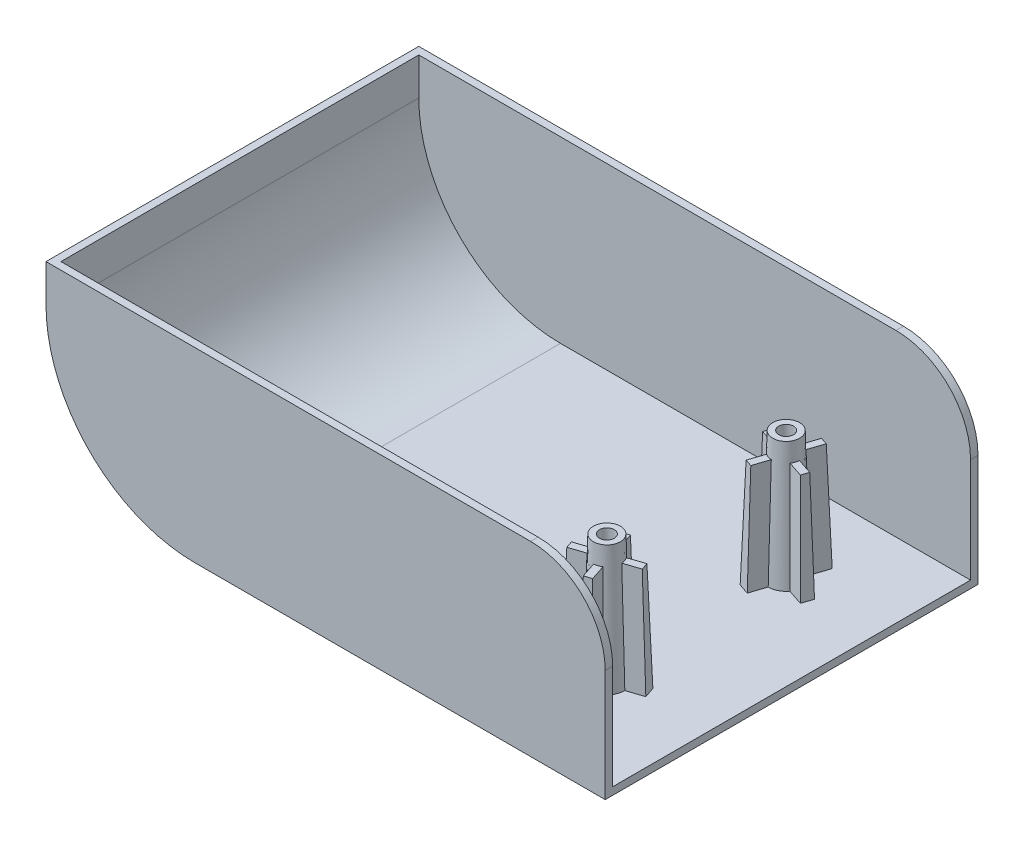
ISO-10303-21;
HEADER;
FILE_DESCRIPTION(('STEP AP214'),'2;1');
FILE_NAME('part.step','',(''),(''),'','','');
FILE_SCHEMA(('AUTOMOTIVE_DESIGN { 1 0 10303 214 1 1 1 1 }'));
ENDSEC;
DATA;
#1=APPLICATION_CONTEXT('core data for automotive mechanical design processes');
#2=APPLICATION_PROTOCOL_DEFINITION('international standard','automotive_design',2000,#1);
#3=PRODUCT_CONTEXT('',#1,'mechanical');
#4=PRODUCT('Part','Part','',(#3));
#5=PRODUCT_RELATED_PRODUCT_CATEGORY('part','',(#4));
#6=PRODUCT_DEFINITION_FORMATION('','',#4);
#7=PRODUCT_DEFINITION_CONTEXT('part definition',#1,'design');
#8=PRODUCT_DEFINITION('design','',#6,#7);
#9=PRODUCT_DEFINITION_SHAPE('','',#8);
#10=(LENGTH_UNIT() NAMED_UNIT(*) SI_UNIT(.MILLI.,.METRE.));
#11=(NAMED_UNIT(*) PLANE_ANGLE_UNIT() SI_UNIT($,.RADIAN.));
#12=(NAMED_UNIT(*) SI_UNIT($,.STERADIAN.) SOLID_ANGLE_UNIT());
#13=UNCERTAINTY_MEASURE_WITH_UNIT(LENGTH_MEASURE(1.E-05),#10,'distance_accuracy_value','');
#14=(GEOMETRIC_REPRESENTATION_CONTEXT(3) GLOBAL_UNCERTAINTY_ASSIGNED_CONTEXT((#13)) GLOBAL_UNIT_ASSIGNED_CONTEXT((#10,
#11,#12)) REPRESENTATION_CONTEXT('',''));
#15=CARTESIAN_POINT('',(0.,0.,0.));
#16=DIRECTION('',(0.,0.,1.));
#17=DIRECTION('',(1.,0.,0.));
#18=AXIS2_PLACEMENT_3D('',#15,#16,#17);
#19=CARTESIAN_POINT('',(0.,0.,25.));
#20=DIRECTION('',(-1.,0.,0.));
#21=DIRECTION('',(0.,0.,1.));
#22=AXIS2_PLACEMENT_3D('',#19,#20,#21);
#23=PLANE('',#22);
#24=DIRECTION('',(0.,1.,0.));
#25=VECTOR('',#24,1.);
#26=CARTESIAN_POINT('',(0.,20.,-24.));
#27=LINE('',#26,#25);
#28=CARTESIAN_POINT('',(0.,1.,-24.));
#29=VERTEX_POINT('',#28);
#30=CARTESIAN_POINT('',(0.,15.,-24.));
#31=VERTEX_POINT('',#30);
#32=EDGE_CURVE('E625',#29,#31,#27,.T.);
#33=ORIENTED_EDGE('',*,*,#32,.F.);
#34=DIRECTION('',(0.,0.,-1.));
#35=VECTOR('',#34,1.);
#36=CARTESIAN_POINT('',(0.,1.,25.));
#37=LINE('',#36,#35);
#38=CARTESIAN_POINT('',(0.,1.,24.));
#39=VERTEX_POINT('',#38);
#40=EDGE_CURVE('E620',#39,#29,#37,.T.);
#41=ORIENTED_EDGE('',*,*,#40,.F.);
#42=DIRECTION('',(0.,1.,0.));
#43=VECTOR('',#42,1.);
#44=CARTESIAN_POINT('',(0.,20.,24.));
#45=LINE('',#44,#43);
#46=CARTESIAN_POINT('',(0.,15.,24.));
#47=VERTEX_POINT('',#46);
#48=EDGE_CURVE('E594',#39,#47,#45,.T.);
#49=ORIENTED_EDGE('',*,*,#48,.T.);
#50=DIRECTION('',(0.,0.,-1.));
#51=VECTOR('',#50,1.);
#52=CARTESIAN_POINT('',(0.,15.,25.));
#53=LINE('',#52,#51);
#54=CARTESIAN_POINT('',(0.,15.,25.));
#55=VERTEX_POINT('',#54);
#56=EDGE_CURVE('E589',#47,#55,#53,.F.);
#57=ORIENTED_EDGE('',*,*,#56,.T.);
#58=DIRECTION('',(0.,1.,0.));
#59=VECTOR('',#58,1.);
#60=CARTESIAN_POINT('',(0.,0.,25.));
#61=LINE('',#60,#59);
#62=CARTESIAN_POINT('',(0.,0.,25.));
#63=VERTEX_POINT('',#62);
#64=EDGE_CURVE('E555',#63,#55,#61,.T.);
#65=ORIENTED_EDGE('',*,*,#64,.F.);
#66=DIRECTION('',(0.,0.,-1.));
#67=VECTOR('',#66,1.);
#68=CARTESIAN_POINT('',(0.,0.,25.));
#69=LINE('',#68,#67);
#70=CARTESIAN_POINT('',(0.,0.,-25.));
#71=VERTEX_POINT('',#70);
#72=EDGE_CURVE('E540',#63,#71,#69,.T.);
#73=ORIENTED_EDGE('',*,*,#72,.T.);
#74=DIRECTION('',(0.,1.,0.));
#75=VECTOR('',#74,1.);
#76=CARTESIAN_POINT('',(0.,0.,-25.));
#77=LINE('',#76,#75);
#78=CARTESIAN_POINT('',(0.,15.,-25.));
#79=VERTEX_POINT('',#78);
#80=EDGE_CURVE('E548',#71,#79,#77,.T.);
#81=ORIENTED_EDGE('',*,*,#80,.T.);
#82=EDGE_CURVE('E40',#79,#31,#53,.F.);
#83=ORIENTED_EDGE('',*,*,#82,.T.);
#84=EDGE_LOOP('',(#33,#41,#49,#57,#65,#73,#81,#83));
#85=FACE_BOUND('',#84,.T.);
#86=ADVANCED_FACE('F32',(#85),#23,.F.);
#87=CARTESIAN_POINT('',(-10.,15.,25.));
#88=DIRECTION('',(0.,0.,-1.));
#89=DIRECTION('',(-1.,0.,0.));
#90=AXIS2_PLACEMENT_3D('',#87,#88,#89);
#91=CYLINDRICAL_SURFACE('',#90,10.);
#92=ORIENTED_EDGE('',*,*,#56,.F.);
#93=CARTESIAN_POINT('',(-10.,15.,24.));
#94=DIRECTION('',(0.,0.,-1.));
#95=DIRECTION('',(-1.,0.,0.));
#96=AXIS2_PLACEMENT_3D('',#93,#94,#95);
#97=CIRCLE('',#96,10.);
#98=CARTESIAN_POINT('',(-10.,25.,24.));
#99=VERTEX_POINT('',#98);
#100=EDGE_CURVE('E601',#47,#99,#97,.F.);
#101=ORIENTED_EDGE('',*,*,#100,.T.);
#102=DIRECTION('',(0.,0.,-1.));
#103=VECTOR('',#102,1.);
#104=CARTESIAN_POINT('',(-10.,25.,25.));
#105=LINE('',#104,#103);
#106=CARTESIAN_POINT('',(-10.,25.,25.));
#107=VERTEX_POINT('',#106);
#108=EDGE_CURVE('E586',#107,#99,#105,.T.);
#109=ORIENTED_EDGE('',*,*,#108,.F.);
#110=CARTESIAN_POINT('',(-10.,15.,25.));
#111=DIRECTION('',(0.,0.,-1.));
#112=DIRECTION('',(-1.,0.,0.));
#113=AXIS2_PLACEMENT_3D('',#110,#111,#112);
#114=CIRCLE('',#113,10.);
#115=EDGE_CURVE('E11',#55,#107,#114,.F.);
#116=ORIENTED_EDGE('',*,*,#115,.F.);
#117=EDGE_LOOP('',(#92,#101,#109,#116));
#118=FACE_BOUND('',#117,.T.);
#119=ADVANCED_FACE('F513',(#118),#91,.T.);
#120=CARTESIAN_POINT('',(-10.,25.,-24.));
#121=VERTEX_POINT('',#120);
#122=CARTESIAN_POINT('',(-10.,25.,-25.));
#123=VERTEX_POINT('',#122);
#124=EDGE_CURVE('E585',#121,#123,#105,.T.);
#125=ORIENTED_EDGE('',*,*,#124,.F.);
#126=CARTESIAN_POINT('',(-10.,15.,-24.));
#127=DIRECTION('',(0.,0.,-1.));
#128=DIRECTION('',(-1.,0.,0.));
#129=AXIS2_PLACEMENT_3D('',#126,#127,#128);
#130=CIRCLE('',#129,10.);
#131=EDGE_CURVE('E611',#121,#31,#130,.T.);
#132=ORIENTED_EDGE('',*,*,#131,.T.);
#133=ORIENTED_EDGE('',*,*,#82,.F.);
#134=CARTESIAN_POINT('',(-10.,15.,-25.));
#135=DIRECTION('',(0.,0.,-1.));
#136=DIRECTION('',(-1.,0.,0.));
#137=AXIS2_PLACEMENT_3D('',#134,#135,#136);
#138=CIRCLE('',#137,10.);
#139=EDGE_CURVE('E561',#123,#79,#138,.T.);
#140=ORIENTED_EDGE('',*,*,#139,.F.);
#141=EDGE_LOOP('',(#125,#132,#133,#140));
#142=FACE_BOUND('',#141,.T.);
#143=ADVANCED_FACE('F519',(#142),#91,.T.);
#144=CARTESIAN_POINT('',(-55.,20.,25.));
#145=DIRECTION('',(0.,0.,-1.));
#146=DIRECTION('',(-1.,0.,0.));
#147=AXIS2_PLACEMENT_3D('',#144,#145,#146);
#148=CYLINDRICAL_SURFACE('',#147,20.);
#149=CARTESIAN_POINT('',(-55.,20.,-25.));
#150=DIRECTION('',(0.,0.,1.));
#151=DIRECTION('',(-1.,0.,0.));
#152=AXIS2_PLACEMENT_3D('',#149,#150,#151);
#153=CIRCLE('',#152,20.);
#154=CARTESIAN_POINT('',(-75.,20.,-25.));
#155=VERTEX_POINT('',#154);
#156=CARTESIAN_POINT('',(-55.,0.,-25.));
#157=VERTEX_POINT('',#156);
#158=EDGE_CURVE('E549',#155,#157,#153,.T.);
#159=ORIENTED_EDGE('',*,*,#158,.T.);
#160=DIRECTION('',(0.,0.,-1.));
#161=VECTOR('',#160,1.);
#162=CARTESIAN_POINT('',(-55.,0.,25.));
#163=LINE('',#162,#161);
#164=CARTESIAN_POINT('',(-55.,0.,25.));
#165=VERTEX_POINT('',#164);
#166=EDGE_CURVE('E543',#165,#157,#163,.T.);
#167=ORIENTED_EDGE('',*,*,#166,.F.);
#168=CARTESIAN_POINT('',(-55.,20.,25.));
#169=DIRECTION('',(0.,0.,1.));
#170=DIRECTION('',(-1.,0.,0.));
#171=AXIS2_PLACEMENT_3D('',#168,#169,#170);
#172=CIRCLE('',#171,20.);
#173=CARTESIAN_POINT('',(-75.,20.,25.));
#174=VERTEX_POINT('',#173);
#175=EDGE_CURVE('E569',#174,#165,#172,.T.);
#176=ORIENTED_EDGE('',*,*,#175,.F.);
#177=DIRECTION('',(0.,0.,-1.));
#178=VECTOR('',#177,1.);
#179=CARTESIAN_POINT('',(-75.,20.,25.));
#180=LINE('',#179,#178);
#181=EDGE_CURVE('E579',#174,#155,#180,.T.);
#182=ORIENTED_EDGE('',*,*,#181,.T.);
#183=EDGE_LOOP('',(#159,#167,#176,#182));
#184=FACE_BOUND('',#183,.T.);
#185=ADVANCED_FACE('F34',(#184),#148,.T.);
#186=CARTESIAN_POINT('',(0.,0.,25.));
#187=DIRECTION('',(0.,1.,0.));
#188=DIRECTION('',(0.,0.,1.));
#189=AXIS2_PLACEMENT_3D('',#186,#187,#188);
#190=PLANE('',#189);
#191=DIRECTION('',(1.,0.,0.));
#192=VECTOR('',#191,1.);
#193=CARTESIAN_POINT('',(0.,0.,-25.));
#194=LINE('',#193,#192);
#195=EDGE_CURVE('E538',#157,#71,#194,.T.);
#196=ORIENTED_EDGE('',*,*,#195,.T.);
#197=ORIENTED_EDGE('',*,*,#72,.F.);
#198=DIRECTION('',(1.,0.,0.));
#199=VECTOR('',#198,1.);
#200=CARTESIAN_POINT('',(0.,0.,25.));
#201=LINE('',#200,#199);
#202=EDGE_CURVE('E572',#165,#63,#201,.T.);
#203=ORIENTED_EDGE('',*,*,#202,.F.);
#204=ORIENTED_EDGE('',*,*,#166,.T.);
#205=EDGE_LOOP('',(#196,#197,#203,#204));
#206=FACE_BOUND('',#205,.T.);
#207=ADVANCED_FACE('F526',(#206),#190,.F.);
#208=CARTESIAN_POINT('',(0.,25.,25.));
#209=DIRECTION('',(0.,-1.,0.));
#210=DIRECTION('',(0.,0.,-1.));
#211=AXIS2_PLACEMENT_3D('',#208,#209,#210);
#212=PLANE('',#211);
#213=ORIENTED_EDGE('',*,*,#108,.T.);
#214=DIRECTION('',(-1.,0.,0.));
#215=VECTOR('',#214,1.);
#216=CARTESIAN_POINT('',(-55.,25.,24.));
#217=LINE('',#216,#215);
#218=CARTESIAN_POINT('',(-74.,25.,24.));
#219=VERTEX_POINT('',#218);
#220=EDGE_CURVE('E604',#99,#219,#217,.T.);
#221=ORIENTED_EDGE('',*,*,#220,.T.);
#222=DIRECTION('',(0.,0.,-1.));
#223=VECTOR('',#222,1.);
#224=CARTESIAN_POINT('',(-74.,25.,25.));
#225=LINE('',#224,#223);
#226=CARTESIAN_POINT('',(-74.,25.,-24.));
#227=VERTEX_POINT('',#226);
#228=EDGE_CURVE('E618',#219,#227,#225,.T.);
#229=ORIENTED_EDGE('',*,*,#228,.T.);
#230=DIRECTION('',(-1.,0.,0.));
#231=VECTOR('',#230,1.);
#232=CARTESIAN_POINT('',(-55.,25.,-24.));
#233=LINE('',#232,#231);
#234=EDGE_CURVE('E622',#121,#227,#233,.T.);
#235=ORIENTED_EDGE('',*,*,#234,.F.);
#236=ORIENTED_EDGE('',*,*,#124,.T.);
#237=DIRECTION('',(-1.,0.,0.));
#238=VECTOR('',#237,1.);
#239=CARTESIAN_POINT('',(0.,25.,-25.));
#240=LINE('',#239,#238);
#241=CARTESIAN_POINT('',(-75.,25.,-25.));
#242=VERTEX_POINT('',#241);
#243=EDGE_CURVE('E562',#123,#242,#240,.T.);
#244=ORIENTED_EDGE('',*,*,#243,.T.);
#245=DIRECTION('',(0.,0.,-1.));
#246=VECTOR('',#245,1.);
#247=CARTESIAN_POINT('',(-75.,25.,25.));
#248=LINE('',#247,#246);
#249=CARTESIAN_POINT('',(-75.,25.,25.));
#250=VERTEX_POINT('',#249);
#251=EDGE_CURVE('E556',#250,#242,#248,.T.);
#252=ORIENTED_EDGE('',*,*,#251,.F.);
#253=DIRECTION('',(-1.,0.,0.));
#254=VECTOR('',#253,1.);
#255=CARTESIAN_POINT('',(0.,25.,25.));
#256=LINE('',#255,#254);
#257=EDGE_CURVE('E575',#107,#250,#256,.T.);
#258=ORIENTED_EDGE('',*,*,#257,.F.);
#259=EDGE_LOOP('',(#213,#221,#229,#235,#236,#244,#252,#258));
#260=FACE_BOUND('',#259,.T.);
#261=ADVANCED_FACE('F524',(#260),#212,.F.);
#262=CARTESIAN_POINT('',(-75.,20.,25.));
#263=DIRECTION('',(1.,0.,0.));
#264=DIRECTION('',(0.,1.,0.));
#265=AXIS2_PLACEMENT_3D('',#262,#263,#264);
#266=PLANE('',#265);
#267=DIRECTION('',(0.,-1.,0.));
#268=VECTOR('',#267,1.);
#269=CARTESIAN_POINT('',(-75.,20.,-25.));
#270=LINE('',#269,#268);
#271=EDGE_CURVE('E564',#242,#155,#270,.T.);
#272=ORIENTED_EDGE('',*,*,#271,.T.);
#273=ORIENTED_EDGE('',*,*,#181,.F.);
#274=DIRECTION('',(0.,-1.,0.));
#275=VECTOR('',#274,1.);
#276=CARTESIAN_POINT('',(-75.,20.,25.));
#277=LINE('',#276,#275);
#278=EDGE_CURVE('E577',#250,#174,#277,.T.);
#279=ORIENTED_EDGE('',*,*,#278,.F.);
#280=ORIENTED_EDGE('',*,*,#251,.T.);
#281=EDGE_LOOP('',(#272,#273,#279,#280));
#282=FACE_BOUND('',#281,.T.);
#283=ADVANCED_FACE('F533',(#282),#266,.F.);
#284=CARTESIAN_POINT('',(-55.,20.,25.));
#285=DIRECTION('',(0.,0.,-1.));
#286=DIRECTION('',(-1.,0.,0.));
#287=AXIS2_PLACEMENT_3D('',#284,#285,#286);
#288=PLANE('',#287);
#289=ORIENTED_EDGE('',*,*,#64,.T.);
#290=ORIENTED_EDGE('',*,*,#115,.T.);
#291=ORIENTED_EDGE('',*,*,#257,.T.);
#292=ORIENTED_EDGE('',*,*,#278,.T.);
#293=ORIENTED_EDGE('',*,*,#175,.T.);
#294=ORIENTED_EDGE('',*,*,#202,.T.);
#295=EDGE_LOOP('',(#289,#290,#291,#292,#293,#294));
#296=FACE_BOUND('',#295,.T.);
#297=ADVANCED_FACE('F598',(#296),#288,.F.);
#298=CARTESIAN_POINT('',(-55.,20.,-25.));
#299=DIRECTION('',(0.,0.,-1.));
#300=DIRECTION('',(-1.,0.,0.));
#301=AXIS2_PLACEMENT_3D('',#298,#299,#300);
#302=PLANE('',#301);
#303=ORIENTED_EDGE('',*,*,#243,.F.);
#304=ORIENTED_EDGE('',*,*,#139,.T.);
#305=ORIENTED_EDGE('',*,*,#80,.F.);
#306=ORIENTED_EDGE('',*,*,#195,.F.);
#307=ORIENTED_EDGE('',*,*,#158,.F.);
#308=ORIENTED_EDGE('',*,*,#271,.F.);
#309=EDGE_LOOP('',(#303,#304,#305,#306,#307,#308));
#310=FACE_BOUND('',#309,.T.);
#311=ADVANCED_FACE('F559',(#310),#302,.T.);
#312=CARTESIAN_POINT('',(-55.,20.,25.));
#313=DIRECTION('',(0.,0.,-1.));
#314=DIRECTION('',(-1.,0.,0.));
#315=AXIS2_PLACEMENT_3D('',#312,#313,#314);
#316=CYLINDRICAL_SURFACE('',#315,19.);
#317=CARTESIAN_POINT('',(-55.,20.,-24.));
#318=DIRECTION('',(0.,0.,-1.));
#319=DIRECTION('',(-1.,0.,0.));
#320=AXIS2_PLACEMENT_3D('',#317,#318,#319);
#321=CIRCLE('',#320,19.);
#322=CARTESIAN_POINT('',(-74.,20.,-24.));
#323=VERTEX_POINT('',#322);
#324=CARTESIAN_POINT('',(-55.,1.,-24.));
#325=VERTEX_POINT('',#324);
#326=EDGE_CURVE('E638',#323,#325,#321,.F.);
#327=ORIENTED_EDGE('',*,*,#326,.F.);
#328=DIRECTION('',(0.,0.,-1.));
#329=VECTOR('',#328,1.);
#330=CARTESIAN_POINT('',(-74.,20.,25.));
#331=LINE('',#330,#329);
#332=CARTESIAN_POINT('',(-74.,20.,24.));
#333=VERTEX_POINT('',#332);
#334=EDGE_CURVE('E621',#333,#323,#331,.T.);
#335=ORIENTED_EDGE('',*,*,#334,.F.);
#336=CARTESIAN_POINT('',(-55.,20.,24.));
#337=DIRECTION('',(0.,0.,-1.));
#338=DIRECTION('',(-1.,0.,0.));
#339=AXIS2_PLACEMENT_3D('',#336,#337,#338);
#340=CIRCLE('',#339,19.);
#341=CARTESIAN_POINT('',(-55.,1.,24.));
#342=VERTEX_POINT('',#341);
#343=EDGE_CURVE('E634',#333,#342,#340,.F.);
#344=ORIENTED_EDGE('',*,*,#343,.T.);
#345=DIRECTION('',(0.,0.,1.));
#346=VECTOR('',#345,1.);
#347=CARTESIAN_POINT('',(-55.,1.,25.));
#348=LINE('',#347,#346);
#349=EDGE_CURVE('E628',#342,#325,#348,.F.);
#350=ORIENTED_EDGE('',*,*,#349,.T.);
#351=EDGE_LOOP('',(#327,#335,#344,#350));
#352=FACE_BOUND('',#351,.T.);
#353=ADVANCED_FACE('F1149',(#352),#316,.F.);
#354=CARTESIAN_POINT('',(0.,1.,25.));
#355=DIRECTION('',(0.,1.,0.));
#356=DIRECTION('',(0.,0.,1.));
#357=AXIS2_PLACEMENT_3D('',#354,#355,#356);
#358=PLANE('',#357);
#359=DIRECTION('',(-0.316227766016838,0.,0.948683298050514));
#360=VECTOR('',#359,1.);
#361=CARTESIAN_POINT('',(-14.2335000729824,1.,6.67099187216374));
#362=LINE('',#361,#360);
#363=CARTESIAN_POINT('',(-8.23938223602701,1.,-11.3113616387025));
#364=VERTEX_POINT('',#363);
#365=CARTESIAN_POINT('',(-8.71372388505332,1.,-9.88833669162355));
#366=VERTEX_POINT('',#365);
#367=EDGE_CURVE('E51',#364,#366,#362,.T.);
#368=ORIENTED_EDGE('',*,*,#367,.T.);
#369=DIRECTION('',(-0.948683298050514,0.,-0.316227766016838));
#370=VECTOR('',#369,1.);
#371=CARTESIAN_POINT('',(-11.0914573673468,1.,-10.6809145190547));
#372=LINE('',#371,#370);
#373=CARTESIAN_POINT('',(-10.8260132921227,1.,-10.5924331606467));
#374=VERTEX_POINT('',#373);
#375=EDGE_CURVE('E892',#366,#374,#372,.T.);
#376=ORIENTED_EDGE('',*,*,#375,.T.);
#377=CARTESIAN_POINT('',(-12.7516531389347,1.,-12.0248825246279));
#378=DIRECTION('',(0.,1.,0.));
#379=DIRECTION('',(0.,0.,1.));
#380=AXIS2_PLACEMENT_3D('',#377,#378,#379);
#381=CIRCLE('',#380,2.4);
#382=CARTESIAN_POINT('',(-12.7610775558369,1.,-9.62490102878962));
#383=VERTEX_POINT('',#382);
#384=EDGE_CURVE('E882',#374,#383,#381,.F.);
#385=ORIENTED_EDGE('',*,*,#384,.T.);
#386=DIRECTION('',(-0.316227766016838,0.,0.948683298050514));
#387=VECTOR('',#386,1.);
#388=CARTESIAN_POINT('',(-12.6725961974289,1.,-9.89034510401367));
#389=LINE('',#388,#387);
#390=CARTESIAN_POINT('',(-13.46517402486,1.,-7.5126116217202));
#391=VERTEX_POINT('',#390);
#392=EDGE_CURVE('E886',#383,#391,#389,.T.);
#393=ORIENTED_EDGE('',*,*,#392,.T.);
#394=DIRECTION('',(-0.948683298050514,0.,-0.316227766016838));
#395=VECTOR('',#394,1.);
#396=CARTESIAN_POINT('',(-31.4475275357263,1.,-13.5067294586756));
#397=LINE('',#396,#395);
#398=CARTESIAN_POINT('',(-14.888198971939,1.,-7.9869532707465));
#399=VERTEX_POINT('',#398);
#400=EDGE_CURVE('E887',#391,#399,#397,.T.);
#401=ORIENTED_EDGE('',*,*,#400,.T.);
#402=DIRECTION('',(0.316227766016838,0.,-0.948683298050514));
#403=VECTOR('',#402,1.);
#404=CARTESIAN_POINT('',(-14.0956211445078,1.,-10.36468675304));
#405=LINE('',#404,#403);
#406=CARTESIAN_POINT('',(-14.1841025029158,1.,-10.0992426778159));
#407=VERTEX_POINT('',#406);
#408=EDGE_CURVE('E885',#399,#407,#405,.T.);
#409=ORIENTED_EDGE('',*,*,#408,.T.);
#410=CARTESIAN_POINT('',(-15.1516346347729,1.,-12.0343069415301));
#411=VERTEX_POINT('',#410);
#412=EDGE_CURVE('E857',#407,#411,#381,.F.);
#413=ORIENTED_EDGE('',*,*,#412,.T.);
#414=DIRECTION('',(-0.948683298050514,0.,-0.316227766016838));
#415=VECTOR('',#414,1.);
#416=CARTESIAN_POINT('',(-14.8861905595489,1.,-11.9458255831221));
#417=LINE('',#416,#415);
#418=CARTESIAN_POINT('',(-17.2639240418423,0.999999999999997,-12.7384034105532));
#419=VERTEX_POINT('',#418);
#420=EDGE_CURVE('E864',#411,#419,#417,.T.);
#421=ORIENTED_EDGE('',*,*,#420,.T.);
#422=DIRECTION('',(0.316227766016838,0.,-0.948683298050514));
#423=VECTOR('',#422,1.);
#424=CARTESIAN_POINT('',(-11.2698062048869,1.,-30.7207569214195));
#425=LINE('',#424,#423);
#426=CARTESIAN_POINT('',(-16.789582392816,1.,-14.1614283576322));
#427=VERTEX_POINT('',#426);
#428=EDGE_CURVE('E327',#419,#427,#425,.T.);
#429=ORIENTED_EDGE('',*,*,#428,.T.);
#430=DIRECTION('',(0.948683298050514,0.,0.316227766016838));
#431=VECTOR('',#430,1.);
#432=CARTESIAN_POINT('',(-14.4118489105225,1.,-13.368850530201));
#433=LINE('',#432,#431);
#434=CARTESIAN_POINT('',(-14.6772929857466,1.,-13.457331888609));
#435=VERTEX_POINT('',#434);
#436=EDGE_CURVE('E862',#427,#435,#433,.T.);
#437=ORIENTED_EDGE('',*,*,#436,.T.);
#438=CARTESIAN_POINT('',(-12.7422287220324,1.,-14.4248640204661));
#439=VERTEX_POINT('',#438);
#440=EDGE_CURVE('E870',#435,#439,#381,.F.);
#441=ORIENTED_EDGE('',*,*,#440,.T.);
#442=DIRECTION('',(0.316227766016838,0.,-0.948683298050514));
#443=VECTOR('',#442,1.);
#444=CARTESIAN_POINT('',(-12.8307100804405,1.,-14.159419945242));
#445=LINE('',#444,#443);
#446=CARTESIAN_POINT('',(-12.0381322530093,1.,-16.5371534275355));
#447=VERTEX_POINT('',#446);
#448=EDGE_CURVE('E883',#439,#447,#445,.T.);
#449=ORIENTED_EDGE('',*,*,#448,.T.);
#450=DIRECTION('',(0.948683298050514,0.,0.316227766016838));
#451=VECTOR('',#450,1.);
#452=CARTESIAN_POINT('',(5.94422125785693,1.,-10.5430355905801));
#453=LINE('',#452,#451);
#454=CARTESIAN_POINT('',(-10.6151073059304,1.,-16.0628117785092));
#455=VERTEX_POINT('',#454);
#456=EDGE_CURVE('E875',#447,#455,#453,.T.);
#457=ORIENTED_EDGE('',*,*,#456,.T.);
#458=DIRECTION('',(-0.316227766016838,0.,0.948683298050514));
#459=VECTOR('',#458,1.);
#460=CARTESIAN_POINT('',(-11.4076851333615,1.,-13.6850782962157));
#461=LINE('',#460,#459);
#462=CARTESIAN_POINT('',(-11.3192037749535,1.,-13.9505223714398));
#463=VERTEX_POINT('',#462);
#464=EDGE_CURVE('E877',#455,#463,#461,.T.);
#465=ORIENTED_EDGE('',*,*,#464,.T.);
#466=CARTESIAN_POINT('',(-10.3516716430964,1.,-12.0154581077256));
#467=VERTEX_POINT('',#466);
#468=EDGE_CURVE('E901',#463,#467,#381,.F.);
#469=ORIENTED_EDGE('',*,*,#468,.T.);
#470=DIRECTION('',(0.948683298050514,0.,0.316227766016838));
#471=VECTOR('',#470,1.);
#472=CARTESIAN_POINT('',(-10.6171157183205,1.,-12.1039394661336));
#473=LINE('',#472,#471);
#474=EDGE_CURVE('E47',#467,#364,#473,.T.);
#475=ORIENTED_EDGE('',*,*,#474,.T.);
#476=EDGE_LOOP('',(#368,#376,#385,#393,#401,#409,#413,#421,#429,#437,#441,#449,#457,#465,#469,#475));
#477=FACE_BOUND('',#476,.T.);
#478=DIRECTION('',(0.316227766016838,0.,0.948683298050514));
#479=VECTOR('',#478,1.);
#480=CARTESIAN_POINT('',(-14.2335000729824,1.,-6.67099187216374));
#481=LINE('',#480,#479);
#482=CARTESIAN_POINT('',(-8.71372388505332,1.,9.88833669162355));
#483=VERTEX_POINT('',#482);
#484=CARTESIAN_POINT('',(-8.23938223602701,1.,11.3113616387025));
#485=VERTEX_POINT('',#484);
#486=EDGE_CURVE('E828',#483,#485,#481,.T.);
#487=ORIENTED_EDGE('',*,*,#486,.T.);
#488=DIRECTION('',(-0.948683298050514,0.,0.316227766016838));
#489=VECTOR('',#488,1.);
#490=CARTESIAN_POINT('',(-10.6171157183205,1.,12.1039394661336));
#491=LINE('',#490,#489);
#492=CARTESIAN_POINT('',(-10.3516716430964,1.,12.0154581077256));
#493=VERTEX_POINT('',#492);
#494=EDGE_CURVE('E832',#485,#493,#491,.T.);
#495=ORIENTED_EDGE('',*,*,#494,.T.);
#496=CARTESIAN_POINT('',(-12.7516531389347,1.,12.0248825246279));
#497=DIRECTION('',(0.,1.,0.));
#498=DIRECTION('',(0.,0.,1.));
#499=AXIS2_PLACEMENT_3D('',#496,#497,#498);
#500=CIRCLE('',#499,2.4);
#501=CARTESIAN_POINT('',(-11.3192037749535,1.,13.9505223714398));
#502=VERTEX_POINT('',#501);
#503=EDGE_CURVE('E1424',#493,#502,#500,.F.);
#504=ORIENTED_EDGE('',*,*,#503,.T.);
#505=DIRECTION('',(0.316227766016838,0.,0.948683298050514));
#506=VECTOR('',#505,1.);
#507=CARTESIAN_POINT('',(-11.4076851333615,1.,13.6850782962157));
#508=LINE('',#507,#506);
#509=CARTESIAN_POINT('',(-10.6151073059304,1.,16.0628117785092));
#510=VERTEX_POINT('',#509);
#511=EDGE_CURVE('E841',#502,#510,#508,.T.);
#512=ORIENTED_EDGE('',*,*,#511,.T.);
#513=DIRECTION('',(-0.948683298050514,0.,0.316227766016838));
#514=VECTOR('',#513,1.);
#515=CARTESIAN_POINT('',(5.94422125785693,1.,10.5430355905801));
#516=LINE('',#515,#514);
#517=CARTESIAN_POINT('',(-12.0381322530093,1.,16.5371534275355));
#518=VERTEX_POINT('',#517);
#519=EDGE_CURVE('E843',#510,#518,#516,.T.);
#520=ORIENTED_EDGE('',*,*,#519,.T.);
#521=DIRECTION('',(-0.316227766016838,0.,-0.948683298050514));
#522=VECTOR('',#521,1.);
#523=CARTESIAN_POINT('',(-12.8307100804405,1.,14.159419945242));
#524=LINE('',#523,#522);
#525=CARTESIAN_POINT('',(-12.7422287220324,1.,14.4248640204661));
#526=VERTEX_POINT('',#525);
#527=EDGE_CURVE('E831',#518,#526,#524,.T.);
#528=ORIENTED_EDGE('',*,*,#527,.T.);
#529=CARTESIAN_POINT('',(-14.6772929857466,1.,13.457331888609));
#530=VERTEX_POINT('',#529);
#531=EDGE_CURVE('E838',#526,#530,#500,.F.);
#532=ORIENTED_EDGE('',*,*,#531,.T.);
#533=DIRECTION('',(-0.948683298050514,0.,0.316227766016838));
#534=VECTOR('',#533,1.);
#535=CARTESIAN_POINT('',(-14.4118489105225,1.,13.368850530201));
#536=LINE('',#535,#534);
#537=CARTESIAN_POINT('',(-16.789582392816,0.999999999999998,14.1614283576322));
#538=VERTEX_POINT('',#537);
#539=EDGE_CURVE('E659',#530,#538,#536,.T.);
#540=ORIENTED_EDGE('',*,*,#539,.T.);
#541=DIRECTION('',(-0.316227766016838,0.,-0.948683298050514));
#542=VECTOR('',#541,1.);
#543=CARTESIAN_POINT('',(-11.2698062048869,1.,30.7207569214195));
#544=LINE('',#543,#542);
#545=CARTESIAN_POINT('',(-17.2639240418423,1.,12.7384034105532));
#546=VERTEX_POINT('',#545);
#547=EDGE_CURVE('E647',#538,#546,#544,.T.);
#548=ORIENTED_EDGE('',*,*,#547,.T.);
#549=DIRECTION('',(0.948683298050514,0.,-0.316227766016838));
#550=VECTOR('',#549,1.);
#551=CARTESIAN_POINT('',(-14.8861905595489,1.,11.9458255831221));
#552=LINE('',#551,#550);
#553=CARTESIAN_POINT('',(-15.1516346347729,1.,12.0343069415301));
#554=VERTEX_POINT('',#553);
#555=EDGE_CURVE('E845',#546,#554,#552,.T.);
#556=ORIENTED_EDGE('',*,*,#555,.T.);
#557=CARTESIAN_POINT('',(-14.1841025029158,1.,10.0992426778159));
#558=VERTEX_POINT('',#557);
#559=EDGE_CURVE('E649',#554,#558,#500,.F.);
#560=ORIENTED_EDGE('',*,*,#559,.T.);
#561=DIRECTION('',(-0.316227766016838,0.,-0.948683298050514));
#562=VECTOR('',#561,1.);
#563=CARTESIAN_POINT('',(-14.0956211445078,1.,10.36468675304));
#564=LINE('',#563,#562);
#565=CARTESIAN_POINT('',(-14.888198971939,1.,7.9869532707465));
#566=VERTEX_POINT('',#565);
#567=EDGE_CURVE('E839',#558,#566,#564,.T.);
#568=ORIENTED_EDGE('',*,*,#567,.T.);
#569=DIRECTION('',(0.948683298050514,0.,-0.316227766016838));
#570=VECTOR('',#569,1.);
#571=CARTESIAN_POINT('',(-31.4475275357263,1.,13.5067294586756));
#572=LINE('',#571,#570);
#573=CARTESIAN_POINT('',(-13.46517402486,1.,7.5126116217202));
#574=VERTEX_POINT('',#573);
#575=EDGE_CURVE('E834',#566,#574,#572,.T.);
#576=ORIENTED_EDGE('',*,*,#575,.T.);
#577=DIRECTION('',(0.316227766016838,0.,0.948683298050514));
#578=VECTOR('',#577,1.);
#579=CARTESIAN_POINT('',(-12.6725961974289,1.,9.89034510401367));
#580=LINE('',#579,#578);
#581=CARTESIAN_POINT('',(-12.7610775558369,1.,9.62490102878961));
#582=VERTEX_POINT('',#581);
#583=EDGE_CURVE('E836',#574,#582,#580,.T.);
#584=ORIENTED_EDGE('',*,*,#583,.T.);
#585=CARTESIAN_POINT('',(-10.8260132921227,1.,10.5924331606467));
#586=VERTEX_POINT('',#585);
#587=EDGE_CURVE('E849',#582,#586,#500,.F.);
#588=ORIENTED_EDGE('',*,*,#587,.T.);
#589=DIRECTION('',(0.948683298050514,0.,-0.316227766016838));
#590=VECTOR('',#589,1.);
#591=CARTESIAN_POINT('',(-11.0914573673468,1.,10.6809145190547));
#592=LINE('',#591,#590);
#593=EDGE_CURVE('E830',#586,#483,#592,.T.);
#594=ORIENTED_EDGE('',*,*,#593,.T.);
#595=EDGE_LOOP('',(#487,#495,#504,#512,#520,#528,#532,#540,#548,#556,#560,#568,#576,#584,#588,#594));
#596=FACE_BOUND('',#595,.T.);
#597=DIRECTION('',(1.,0.,0.));
#598=VECTOR('',#597,1.);
#599=CARTESIAN_POINT('',(-55.,1.,-24.));
#600=LINE('',#599,#598);
#601=EDGE_CURVE('E630',#325,#29,#600,.T.);
#602=ORIENTED_EDGE('',*,*,#601,.F.);
#603=ORIENTED_EDGE('',*,*,#349,.F.);
#604=DIRECTION('',(1.,0.,0.));
#605=VECTOR('',#604,1.);
#606=CARTESIAN_POINT('',(-55.,1.,24.));
#607=LINE('',#606,#605);
#608=EDGE_CURVE('E614',#342,#39,#607,.T.);
#609=ORIENTED_EDGE('',*,*,#608,.T.);
#610=ORIENTED_EDGE('',*,*,#40,.T.);
#611=EDGE_LOOP('',(#602,#603,#609,#610));
#612=FACE_BOUND('',#611,.T.);
#613=ADVANCED_FACE('F872',(#477,#596,#612),#358,.T.);
#614=CARTESIAN_POINT('',(-74.,20.,25.));
#615=DIRECTION('',(1.,0.,0.));
#616=DIRECTION('',(0.,1.,0.));
#617=AXIS2_PLACEMENT_3D('',#614,#615,#616);
#618=PLANE('',#617);
#619=DIRECTION('',(0.,-1.,0.));
#620=VECTOR('',#619,1.);
#621=CARTESIAN_POINT('',(-74.,19.9999999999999,-24.));
#622=LINE('',#621,#620);
#623=EDGE_CURVE('E624',#227,#323,#622,.T.);
#624=ORIENTED_EDGE('',*,*,#623,.F.);
#625=ORIENTED_EDGE('',*,*,#228,.F.);
#626=DIRECTION('',(0.,-1.,0.));
#627=VECTOR('',#626,1.);
#628=CARTESIAN_POINT('',(-74.,19.9999999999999,24.));
#629=LINE('',#628,#627);
#630=EDGE_CURVE('E617',#219,#333,#629,.T.);
#631=ORIENTED_EDGE('',*,*,#630,.T.);
#632=ORIENTED_EDGE('',*,*,#334,.T.);
#633=EDGE_LOOP('',(#624,#625,#631,#632));
#634=FACE_BOUND('',#633,.T.);
#635=ADVANCED_FACE('F1148',(#634),#618,.T.);
#636=CARTESIAN_POINT('',(-55.,20.,24.));
#637=DIRECTION('',(0.,0.,-1.));
#638=DIRECTION('',(-1.,0.,0.));
#639=AXIS2_PLACEMENT_3D('',#636,#637,#638);
#640=PLANE('',#639);
#641=ORIENTED_EDGE('',*,*,#48,.F.);
#642=ORIENTED_EDGE('',*,*,#608,.F.);
#643=ORIENTED_EDGE('',*,*,#343,.F.);
#644=ORIENTED_EDGE('',*,*,#630,.F.);
#645=ORIENTED_EDGE('',*,*,#220,.F.);
#646=ORIENTED_EDGE('',*,*,#100,.F.);
#647=EDGE_LOOP('',(#641,#642,#643,#644,#645,#646));
#648=FACE_BOUND('',#647,.T.);
#649=ADVANCED_FACE('F1308',(#648),#640,.T.);
#650=CARTESIAN_POINT('',(-55.,20.,-24.));
#651=DIRECTION('',(0.,0.,-1.));
#652=DIRECTION('',(-1.,0.,0.));
#653=AXIS2_PLACEMENT_3D('',#650,#651,#652);
#654=PLANE('',#653);
#655=ORIENTED_EDGE('',*,*,#234,.T.);
#656=ORIENTED_EDGE('',*,*,#623,.T.);
#657=ORIENTED_EDGE('',*,*,#326,.T.);
#658=ORIENTED_EDGE('',*,*,#601,.T.);
#659=ORIENTED_EDGE('',*,*,#32,.T.);
#660=ORIENTED_EDGE('',*,*,#131,.F.);
#661=EDGE_LOOP('',(#655,#656,#657,#658,#659,#660));
#662=FACE_BOUND('',#661,.T.);
#663=ADVANCED_FACE('F1299',(#662),#654,.F.);
#664=CARTESIAN_POINT('',(-12.7516531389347,17.9999999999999,12.0248825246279));
#665=DIRECTION('',(0.,1.,0.));
#666=DIRECTION('',(0.948683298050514,0.,-0.316227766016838));
#667=AXIS2_PLACEMENT_3D('',#664,#665,#666);
#668=PLANE('',#667);
#669=CARTESIAN_POINT('',(-12.7516531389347,18.,12.0248825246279));
#670=DIRECTION('',(0.,-1.,0.));
#671=DIRECTION('',(-0.948683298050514,0.,0.316227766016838));
#672=AXIS2_PLACEMENT_3D('',#669,#670,#671);
#673=CIRCLE('',#672,1.);
#674=CARTESIAN_POINT('',(-13.7003364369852,18.,12.3411102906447));
#675=VERTEX_POINT('',#674);
#676=EDGE_CURVE('E824',#675,#675,#673,.T.);
#677=ORIENTED_EDGE('',*,*,#676,.T.);
#678=EDGE_LOOP('',(#677));
#679=FACE_BOUND('',#678,.T.);
#680=CARTESIAN_POINT('',(-12.7516531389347,17.9999999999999,12.0248825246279));
#681=DIRECTION('',(0.,-1.,0.));
#682=DIRECTION('',(-0.948683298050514,0.,0.316227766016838));
#683=AXIS2_PLACEMENT_3D('',#680,#681,#682);
#684=CIRCLE('',#683,1.80634691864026);
#685=CARTESIAN_POINT('',(-14.4653042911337,17.9999999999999,12.5960995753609));
#686=VERTEX_POINT('',#685);
#687=EDGE_CURVE('E772',#686,#686,#684,.T.);
#688=ORIENTED_EDGE('',*,*,#687,.F.);
#689=EDGE_LOOP('',(#688));
#690=FACE_BOUND('',#689,.T.);
#691=ADVANCED_FACE('F1290',(#679,#690),#668,.T.);
#692=CARTESIAN_POINT('',(-12.7516531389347,17.9999999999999,12.0248825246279));
#693=DIRECTION('',(0.,-1.,0.));
#694=DIRECTION('',(-0.948683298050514,0.,0.316227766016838));
#695=AXIS2_PLACEMENT_3D('',#692,#693,#694);
#696=CONICAL_SURFACE('',#695,1.80634691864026,0.0349065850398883);
#697=ORIENTED_EDGE('',*,*,#559,.F.);
#698=CARTESIAN_POINT('',(-14.6423012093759,15.5002,12.1313219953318));
#699=CARTESIAN_POINT('',(-14.6853883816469,14.2811323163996,12.1232544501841));
#700=CARTESIAN_POINT('',(-14.7283975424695,13.0620620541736,12.1151608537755));
#701=CARTESIAN_POINT('',(-14.9430953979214,6.96669917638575,12.0745766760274));
#702=CARTESIAN_POINT('',(-15.1137402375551,2.09037211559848,12.0417375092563));
#703=CARTESIAN_POINT('',(-15.453880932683,-7.6623194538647,11.9756754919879));
#704=CARTESIAN_POINT('',(-15.6233767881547,-12.5386839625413,11.9424526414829));
#705=CARTESIAN_POINT('',(-15.9616596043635,-22.2914359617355,11.8757702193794));
#706=CARTESIAN_POINT('',(-16.1304465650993,-27.167823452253,11.8423106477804));
#707=CARTESIAN_POINT('',(-16.4675655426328,-36.9206132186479,11.7752395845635));
#708=CARTESIAN_POINT('',(-16.6358975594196,-41.7970154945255,11.7416280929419));
#709=CARTESIAN_POINT('',(-16.9722471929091,-51.5498301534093,11.6743001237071));
#710=CARTESIAN_POINT('',(-17.1402648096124,-56.4262425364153,11.6405836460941));
#711=CARTESIAN_POINT('',(-17.6439874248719,-71.0554898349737,11.5393239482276));
#712=CARTESIAN_POINT('',(-17.9793622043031,-80.8083353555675,11.4716704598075));
#713=CARTESIAN_POINT('',(-18.6496201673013,-100.314042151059,11.336199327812));
#714=CARTESIAN_POINT('',(-18.9845033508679,-110.066903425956,11.2683816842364));
#715=CARTESIAN_POINT('',(-19.9887041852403,-139.325501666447,11.0647789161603));
#716=CARTESIAN_POINT('',(-20.6575731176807,-158.831252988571,10.9288439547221));
#717=CARTESIAN_POINT('',(-21.9947769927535,-197.842772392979,10.6567957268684));
#718=CARTESIAN_POINT('',(-22.6631119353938,-217.348540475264,10.5206824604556));
#719=CARTESIAN_POINT('',(-23.9994792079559,-256.360086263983,10.2483548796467));
#720=CARTESIAN_POINT('',(-24.6675115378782,-275.865863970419,10.1121405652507));
#721=CARTESIAN_POINT('',(-26.3393960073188,-324.689482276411,9.77111723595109));
#722=CARTESIAN_POINT('',(-27.3431361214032,-354.007326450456,9.56627081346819));
#723=CARTESIAN_POINT('',(-29.3504027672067,-412.643021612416,9.15650664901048));
#724=CARTESIAN_POINT('',(-30.3539292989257,-441.96087260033,8.95158890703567));
#725=CARTESIAN_POINT('',(-33.3643217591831,-529.914431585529,8.33677319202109));
#726=CARTESIAN_POINT('',(-35.371000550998,-588.550145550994,7.92681273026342));
#727=CARTESIAN_POINT('',(-39.3841500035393,-705.821580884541,7.10682229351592));
#728=CARTESIAN_POINT('',(-41.390620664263,-764.457302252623,6.69679231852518));
#729=CARTESIAN_POINT('',(-45.4034382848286,-881.72874887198,5.87669106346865));
#730=CARTESIAN_POINT('',(-47.4097852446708,-940.364474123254,5.46661978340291));
#731=CARTESIAN_POINT('',(-49.4161125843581,-999.0002,5.05654195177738));
#732=B_SPLINE_CURVE_WITH_KNOTS('',3,(#698,#699,#700,#701,#702,#703,#704,#705,#706,#707,#708,
#709,#710,#711,#712,#713,#714,#715,#716,#717,#718,#719,#720,#721,#722,#723,#724,#725,#726,#727,
#728,#729,#730,#731),.UNSPECIFIED.,.F.,.F.,(4,2,2,2,2,2,2,2,2,2,2,2,2,2,2,2,4),(0.,
3.65956668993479,18.2978337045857,32.9361010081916,47.5743683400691,62.2126360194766,
76.8509036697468,106.127437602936,135.403971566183,193.957039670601,252.510106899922,
311.063174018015,399.07038388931,487.077593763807,663.092013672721,839.106435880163,
1015.12085790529),.UNSPECIFIED.);
#733=CARTESIAN_POINT('',(-14.6423082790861,15.5,12.1313206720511));
#734=VERTEX_POINT('',#733);
#735=EDGE_CURVE('E650',#734,#554,#732,.T.);
#736=ORIENTED_EDGE('',*,*,#735,.F.);
#737=CARTESIAN_POINT('',(-12.7516531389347,15.5,12.0248825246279));
#738=DIRECTION('',(0.,1.,0.));
#739=DIRECTION('',(0.948683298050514,0.,-0.316227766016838));
#740=AXIS2_PLACEMENT_3D('',#737,#738,#739);
#741=CIRCLE('',#740,1.89364884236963);
#742=CARTESIAN_POINT('',(-14.3280401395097,15.5,13.0741250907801));
#743=VERTEX_POINT('',#742);
#744=EDGE_CURVE('E660',#743,#734,#741,.F.);
#745=ORIENTED_EDGE('',*,*,#744,.F.);
#746=CARTESIAN_POINT('',(-37.9022163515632,-999.0002,39.5982306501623));
#747=CARTESIAN_POINT('',(-37.623779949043,-986.98678309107,39.284380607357));
#748=CARTESIAN_POINT('',(-37.3453420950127,-974.973366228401,38.9705300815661));
#749=CARTESIAN_POINT('',(-36.7884631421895,-950.946532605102,38.3428279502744));
#750=CARTESIAN_POINT('',(-36.5100220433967,-938.933115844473,38.0289763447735));
#751=CARTESIAN_POINT('',(-35.674693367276,-902.892865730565,37.0874197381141));
#752=CARTESIAN_POINT('',(-35.1178004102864,-878.86603254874,36.4597129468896));
#753=CARTESIAN_POINT('',(-34.003996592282,-830.812366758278,35.2042934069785));
#754=CARTESIAN_POINT('',(-33.4470857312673,-806.785534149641,34.5765806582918));
#755=CARTESIAN_POINT('',(-32.3332412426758,-758.731869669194,33.3211475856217));
#756=CARTESIAN_POINT('',(-31.7763076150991,-734.705037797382,32.6934272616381));
#757=CARTESIAN_POINT('',(-30.6624107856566,-686.651374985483,31.4379767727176));
#758=CARTESIAN_POINT('',(-30.1054475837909,-662.624544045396,30.8102466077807));
#759=CARTESIAN_POINT('',(-28.9166669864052,-611.343557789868,29.4704545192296));
#760=CARTESIAN_POINT('',(-28.2848439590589,-584.089402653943,28.7583907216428));
#761=CARTESIAN_POINT('',(-27.0211256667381,-529.581094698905,27.3342390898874));
#762=CARTESIAN_POINT('',(-26.3892304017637,-502.326941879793,26.6221512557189));
#763=CARTESIAN_POINT('',(-25.1253306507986,-447.818639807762,25.1979392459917));
#764=CARTESIAN_POINT('',(-24.4933261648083,-420.564490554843,24.4858150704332));
#765=CARTESIAN_POINT('',(-23.2291439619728,-366.056197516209,23.0615090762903));
#766=CARTESIAN_POINT('',(-22.5969662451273,-338.802053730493,22.3493272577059));
#767=CARTESIAN_POINT('',(-21.6484670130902,-297.920845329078,21.2809771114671));
#768=CARTESIAN_POINT('',(-21.3322618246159,-284.293777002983,20.9248474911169));
#769=CARTESIAN_POINT('',(-20.6997414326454,-257.039643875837,20.2125516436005));
#770=CARTESIAN_POINT('',(-20.3834262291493,-243.412579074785,19.8563854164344));
#771=CARTESIAN_POINT('',(-19.7506373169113,-216.158454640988,19.1440002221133));
#772=CARTESIAN_POINT('',(-19.4341636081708,-202.531395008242,18.7877812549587));
#773=CARTESIAN_POINT('',(-18.8009727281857,-175.277283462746,18.0752623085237));
#774=CARTESIAN_POINT('',(-18.4842555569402,-161.650231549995,17.718962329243));
#775=CARTESIAN_POINT('',(-17.850428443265,-134.396139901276,17.0062316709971));
#776=CARTESIAN_POINT('',(-17.5333185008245,-120.769100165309,16.6498009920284));
#777=CARTESIAN_POINT('',(-17.0571091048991,-100.328558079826,16.1149738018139));
#778=CARTESIAN_POINT('',(-16.8982818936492,-93.5150470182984,15.9366678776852));
#779=CARTESIAN_POINT('',(-16.5803648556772,-79.8880332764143,15.5799686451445));
#780=CARTESIAN_POINT('',(-16.4212750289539,-73.0745305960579,15.401575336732));
#781=CARTESIAN_POINT('',(-16.1027048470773,-59.447537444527,15.0446587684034));
#782=CARTESIAN_POINT('',(-15.9432244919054,-52.6340469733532,14.8661355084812));
#783=CARTESIAN_POINT('',(-15.6236517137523,-39.0070857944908,14.5088853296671));
#784=CARTESIAN_POINT('',(-15.4635592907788,-32.1936150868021,14.3301584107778));
#785=CARTESIAN_POINT('',(-15.2226172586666,-21.973434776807,14.0618007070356));
#786=CARTESIAN_POINT('',(-15.1421693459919,-18.5667121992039,13.9723035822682));
#787=CARTESIAN_POINT('',(-14.9808955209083,-11.7532793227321,13.7931835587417));
#788=CARTESIAN_POINT('',(-14.9000696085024,-8.3465690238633,13.7035606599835));
#789=CARTESIAN_POINT('',(-14.7378925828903,-1.5331653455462,13.5241401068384));
#790=CARTESIAN_POINT('',(-14.6565414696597,1.87352803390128,13.4343424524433));
#791=CARTESIAN_POINT('',(-14.4929981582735,8.68688729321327,13.2544672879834));
#792=CARTESIAN_POINT('',(-14.4108059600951,12.093553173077,13.1643897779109));
#793=CARTESIAN_POINT('',(-14.32803527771,15.5001999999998,13.0741197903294));
#794=B_SPLINE_CURVE_WITH_KNOTS('',3,(#746,#747,#748,#749,#750,#751,#752,#753,#754,#755,#756,
#757,#758,#759,#760,#761,#762,#763,#764,#765,#766,#767,#768,#769,#770,#771,#772,#773,#774,#775,
#776,#777,#778,#779,#780,#781,#782,#783,#784,#785,#786,#787,#788,#789,#790,#791,#792,#793),
.UNSPECIFIED.,.F.,.F.,(4,2,2,2,2,2,2,2,2,2,2,2,2,2,2,2,2,2,2,2,2,2,2,4),(0.,36.0622230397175,
72.1244460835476,144.248892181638,216.37333827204,288.497784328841,360.622230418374,
442.434557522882,524.246884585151,606.059211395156,687.871538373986,728.777702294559,
769.683866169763,810.59002971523,851.49619342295,892.40235824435,912.855440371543,
933.308522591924,953.761605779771,974.214688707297,984.441230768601,994.667772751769,
1004.89431520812,1015.12085794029),.UNSPECIFIED.);
#795=EDGE_CURVE('E681',#530,#743,#794,.T.);
#796=ORIENTED_EDGE('',*,*,#795,.F.);
#797=ORIENTED_EDGE('',*,*,#531,.F.);
#798=CARTESIAN_POINT('',(-12.6452136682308,15.5002,13.9155305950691));
#799=CARTESIAN_POINT('',(-12.6532812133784,14.2811323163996,13.9586177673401));
#800=CARTESIAN_POINT('',(-12.6613748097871,13.0620620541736,14.0016269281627));
#801=CARTESIAN_POINT('',(-12.7019589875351,6.96669917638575,14.2163247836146));
#802=CARTESIAN_POINT('',(-12.7347981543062,2.09037211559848,14.3869696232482));
#803=CARTESIAN_POINT('',(-12.8008601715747,-7.6623194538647,14.7271103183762));
#804=CARTESIAN_POINT('',(-12.8340830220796,-12.5386839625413,14.8966061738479));
#805=CARTESIAN_POINT('',(-12.9007654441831,-22.2914359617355,15.2348889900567));
#806=CARTESIAN_POINT('',(-12.9342250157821,-27.167823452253,15.4036759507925));
#807=CARTESIAN_POINT('',(-13.001296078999,-36.9206132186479,15.740794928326));
#808=CARTESIAN_POINT('',(-13.0349075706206,-41.7970154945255,15.9091269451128));
#809=CARTESIAN_POINT('',(-13.1022355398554,-51.5498301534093,16.2454765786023));
#810=CARTESIAN_POINT('',(-13.1359520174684,-56.4262425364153,16.4134941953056));
#811=CARTESIAN_POINT('',(-13.2372117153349,-71.0554898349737,16.9172168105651));
#812=CARTESIAN_POINT('',(-13.304865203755,-80.8083353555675,17.2525915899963));
#813=CARTESIAN_POINT('',(-13.4403363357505,-100.314042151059,17.9228495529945));
#814=CARTESIAN_POINT('',(-13.5081539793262,-110.066903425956,18.2577327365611));
#815=CARTESIAN_POINT('',(-13.7117567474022,-139.325501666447,19.2619335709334));
#816=CARTESIAN_POINT('',(-13.8476917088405,-158.831252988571,19.9308025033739));
#817=CARTESIAN_POINT('',(-14.1197399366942,-197.842772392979,21.2680063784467));
#818=CARTESIAN_POINT('',(-14.2558532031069,-217.348540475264,21.936341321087));
#819=CARTESIAN_POINT('',(-14.5281807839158,-256.360086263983,23.2727085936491));
#820=CARTESIAN_POINT('',(-14.6643950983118,-275.865863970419,23.9407409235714));
#821=CARTESIAN_POINT('',(-15.0054184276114,-324.689482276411,25.612625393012));
#822=CARTESIAN_POINT('',(-15.2102648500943,-354.007326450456,26.6163655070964));
#823=CARTESIAN_POINT('',(-15.6200290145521,-412.643021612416,28.6236321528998));
#824=CARTESIAN_POINT('',(-15.8249467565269,-441.96087260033,29.6271586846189));
#825=CARTESIAN_POINT('',(-16.4397624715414,-529.914431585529,32.6375511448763));
#826=CARTESIAN_POINT('',(-16.8497229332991,-588.550145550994,34.6442299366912));
#827=CARTESIAN_POINT('',(-17.6697133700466,-705.821580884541,38.6573793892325));
#828=CARTESIAN_POINT('',(-18.0797433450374,-764.457302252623,40.6638500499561));
#829=CARTESIAN_POINT('',(-18.8998446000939,-881.72874887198,44.6766676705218));
#830=CARTESIAN_POINT('',(-19.3099158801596,-940.364474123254,46.6830146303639));
#831=CARTESIAN_POINT('',(-19.7199937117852,-999.0002,48.6893419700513));
#832=B_SPLINE_CURVE_WITH_KNOTS('',3,(#798,#799,#800,#801,#802,#803,#804,#805,#806,#807,#808,
#809,#810,#811,#812,#813,#814,#815,#816,#817,#818,#819,#820,#821,#822,#823,#824,#825,#826,#827,
#828,#829,#830,#831),.UNSPECIFIED.,.F.,.F.,(4,2,2,2,2,2,2,2,2,2,2,2,2,2,2,2,4),(0.,
3.65956668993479,18.2978337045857,32.9361010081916,47.5743683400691,62.2126360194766,
76.8509036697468,106.127437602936,135.403971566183,193.957039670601,252.510106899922,
311.063174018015,399.07038388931,487.077593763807,663.092013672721,839.106435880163,
1015.12085790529),.UNSPECIFIED.);
#833=CARTESIAN_POINT('',(-12.6452149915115,15.5,13.9155376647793));
#834=VERTEX_POINT('',#833);
#835=EDGE_CURVE('E687',#834,#526,#832,.T.);
#836=ORIENTED_EDGE('',*,*,#835,.F.);
#837=CARTESIAN_POINT('',(-12.7516531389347,15.5,12.0248825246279));
#838=DIRECTION('',(0.,1.,0.));
#839=DIRECTION('',(0.948683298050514,0.,-0.316227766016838));
#840=AXIS2_PLACEMENT_3D('',#837,#838,#839);
#841=CIRCLE('',#840,1.89364884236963);
#842=CARTESIAN_POINT('',(-11.7024105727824,15.5,13.6012695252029));
#843=VERTEX_POINT('',#842);
#844=EDGE_CURVE('E695',#843,#834,#841,.F.);
#845=ORIENTED_EDGE('',*,*,#844,.F.);
#846=CARTESIAN_POINT('',(14.8216949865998,-999.0002,37.1754457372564));
#847=CARTESIAN_POINT('',(14.5078449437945,-986.98678309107,36.8970093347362));
#848=CARTESIAN_POINT('',(14.1939944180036,-974.973366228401,36.6185714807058));
#849=CARTESIAN_POINT('',(13.5662922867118,-950.946532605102,36.0616925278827));
#850=CARTESIAN_POINT('',(13.252440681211,-938.933115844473,35.7832514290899));
#851=CARTESIAN_POINT('',(12.3108840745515,-902.892865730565,34.9479227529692));
#852=CARTESIAN_POINT('',(11.683177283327,-878.86603254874,34.3910297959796));
#853=CARTESIAN_POINT('',(10.4277577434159,-830.812366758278,33.2772259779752));
#854=CARTESIAN_POINT('',(9.80004499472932,-806.785534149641,32.7203151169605));
#855=CARTESIAN_POINT('',(8.54461192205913,-758.731869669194,31.606470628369));
#856=CARTESIAN_POINT('',(7.91689159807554,-734.705037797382,31.0495370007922));
#857=CARTESIAN_POINT('',(6.66144110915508,-686.651374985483,29.9356401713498));
#858=CARTESIAN_POINT('',(6.03371094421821,-662.624544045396,29.3786769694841));
#859=CARTESIAN_POINT('',(4.69391885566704,-611.343557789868,28.1898963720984));
#860=CARTESIAN_POINT('',(3.98185505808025,-584.089402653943,27.5580733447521));
#861=CARTESIAN_POINT('',(2.5577034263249,-529.581094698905,26.2943550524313));
#862=CARTESIAN_POINT('',(1.84561559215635,-502.326941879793,25.6624597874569));
#863=CARTESIAN_POINT('',(0.421403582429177,-447.818639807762,24.3985600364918));
#864=CARTESIAN_POINT('',(-0.29072059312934,-420.564490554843,23.7665555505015));
#865=CARTESIAN_POINT('',(-1.7150265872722,-366.056197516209,22.502373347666));
#866=CARTESIAN_POINT('',(-2.42720840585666,-338.802053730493,21.8701956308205));
#867=CARTESIAN_POINT('',(-3.49555855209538,-297.920845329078,20.9216963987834));
#868=CARTESIAN_POINT('',(-3.85168817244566,-284.293777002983,20.6054912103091));
#869=CARTESIAN_POINT('',(-4.56398401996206,-257.039643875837,19.9729708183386));
#870=CARTESIAN_POINT('',(-4.92015024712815,-243.412579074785,19.6566556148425));
#871=CARTESIAN_POINT('',(-5.63253544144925,-216.158454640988,19.0238667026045));
#872=CARTESIAN_POINT('',(-5.98875440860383,-202.531395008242,18.7073929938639));
#873=CARTESIAN_POINT('',(-6.70127335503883,-175.277283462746,18.0742021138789));
#874=CARTESIAN_POINT('',(-7.05757333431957,-161.650231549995,17.7574849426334));
#875=CARTESIAN_POINT('',(-7.77030399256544,-134.396139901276,17.1236578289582));
#876=CARTESIAN_POINT('',(-8.12673467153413,-120.769100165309,16.8065478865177));
#877=CARTESIAN_POINT('',(-8.66156186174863,-100.328558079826,16.3303384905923));
#878=CARTESIAN_POINT('',(-8.8398677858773,-93.5150470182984,16.1715112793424));
#879=CARTESIAN_POINT('',(-9.19656701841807,-79.8880332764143,15.8535942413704));
#880=CARTESIAN_POINT('',(-9.37496032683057,-73.0745305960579,15.6945044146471));
#881=CARTESIAN_POINT('',(-9.73187689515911,-59.447537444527,15.3759342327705));
#882=CARTESIAN_POINT('',(-9.91040015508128,-52.6340469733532,15.2164538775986));
#883=CARTESIAN_POINT('',(-10.2676503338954,-39.0070857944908,14.8968810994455));
#884=CARTESIAN_POINT('',(-10.4463772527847,-32.1936150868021,14.736788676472));
#885=CARTESIAN_POINT('',(-10.714734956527,-21.973434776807,14.4958466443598));
#886=CARTESIAN_POINT('',(-10.8042320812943,-18.5667121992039,14.4153987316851));
#887=CARTESIAN_POINT('',(-10.9833521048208,-11.7532793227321,14.2541249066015));
#888=CARTESIAN_POINT('',(-11.072975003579,-8.3465690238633,14.1732989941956));
#889=CARTESIAN_POINT('',(-11.2523955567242,-1.5331653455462,14.0111219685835));
#890=CARTESIAN_POINT('',(-11.3421932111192,1.87352803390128,13.9297708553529));
#891=CARTESIAN_POINT('',(-11.5220683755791,8.68688729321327,13.7662275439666));
#892=CARTESIAN_POINT('',(-11.6121458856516,12.093553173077,13.6840353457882));
#893=CARTESIAN_POINT('',(-11.7024158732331,15.5001999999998,13.6012646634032));
#894=B_SPLINE_CURVE_WITH_KNOTS('',3,(#846,#847,#848,#849,#850,#851,#852,#853,#854,#855,#856,
#857,#858,#859,#860,#861,#862,#863,#864,#865,#866,#867,#868,#869,#870,#871,#872,#873,#874,#875,
#876,#877,#878,#879,#880,#881,#882,#883,#884,#885,#886,#887,#888,#889,#890,#891,#892,#893),
.UNSPECIFIED.,.F.,.F.,(4,2,2,2,2,2,2,2,2,2,2,2,2,2,2,2,2,2,2,2,2,2,2,4),(0.,36.0622230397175,
72.1244460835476,144.248892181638,216.37333827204,288.497784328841,360.622230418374,
442.434557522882,524.246884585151,606.059211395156,687.871538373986,728.777702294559,
769.683866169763,810.59002971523,851.49619342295,892.40235824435,912.855440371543,
933.308522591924,953.761605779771,974.214688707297,984.441230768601,994.667772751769,
1004.89431520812,1015.12085794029),.UNSPECIFIED.);
#895=EDGE_CURVE('E710',#502,#843,#894,.T.);
#896=ORIENTED_EDGE('',*,*,#895,.F.);
#897=ORIENTED_EDGE('',*,*,#503,.F.);
#898=CARTESIAN_POINT('',(-10.8610050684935,15.5002,11.9184430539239));
#899=CARTESIAN_POINT('',(-10.8179178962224,14.2811323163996,11.9265105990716));
#900=CARTESIAN_POINT('',(-10.7749087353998,13.0620620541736,11.9346041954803));
#901=CARTESIAN_POINT('',(-10.560210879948,6.96669917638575,11.9751883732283));
#902=CARTESIAN_POINT('',(-10.3895660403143,2.09037211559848,12.0080275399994));
#903=CARTESIAN_POINT('',(-10.0494253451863,-7.6623194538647,12.0740895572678));
#904=CARTESIAN_POINT('',(-9.87992948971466,-12.5386839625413,12.1073124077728));
#905=CARTESIAN_POINT('',(-9.54164667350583,-22.2914359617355,12.1739948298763));
#906=CARTESIAN_POINT('',(-9.37285971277,-27.167823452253,12.2074544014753));
#907=CARTESIAN_POINT('',(-9.03574073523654,-36.9206132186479,12.2745254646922));
#908=CARTESIAN_POINT('',(-8.86740871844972,-41.7970154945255,12.3081369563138));
#909=CARTESIAN_POINT('',(-8.53105908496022,-51.5498301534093,12.3754649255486));
#910=CARTESIAN_POINT('',(-8.36304146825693,-56.4262425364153,12.4091814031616));
#911=CARTESIAN_POINT('',(-7.85931885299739,-71.0554898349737,12.5104411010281));
#912=CARTESIAN_POINT('',(-7.52394407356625,-80.8083353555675,12.5780945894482));
#913=CARTESIAN_POINT('',(-6.85368611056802,-100.314042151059,12.7135657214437));
#914=CARTESIAN_POINT('',(-6.51880292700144,-110.066903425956,12.7813833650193));
#915=CARTESIAN_POINT('',(-5.51460209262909,-139.325501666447,12.9849861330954));
#916=CARTESIAN_POINT('',(-4.84573316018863,-158.831252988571,13.1209210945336));
#917=CARTESIAN_POINT('',(-3.50852928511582,-197.842772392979,13.3929693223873));
#918=CARTESIAN_POINT('',(-2.8401943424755,-217.348540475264,13.5290825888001));
#919=CARTESIAN_POINT('',(-1.50382706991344,-256.360086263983,13.801410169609));
#920=CARTESIAN_POINT('',(-0.835794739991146,-275.865863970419,13.937624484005));
#921=CARTESIAN_POINT('',(0.83608972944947,-324.689482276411,14.2786478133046));
#922=CARTESIAN_POINT('',(1.83982984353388,-354.007326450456,14.4834942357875));
#923=CARTESIAN_POINT('',(3.84709648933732,-412.643021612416,14.8932584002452));
#924=CARTESIAN_POINT('',(4.85062302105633,-441.96087260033,15.09817614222));
#925=CARTESIAN_POINT('',(7.86101548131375,-529.914431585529,15.7129918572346));
#926=CARTESIAN_POINT('',(9.86769427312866,-588.550145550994,16.1229523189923));
#927=CARTESIAN_POINT('',(13.88084372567,-705.821580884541,16.9429427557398));
#928=CARTESIAN_POINT('',(15.8873143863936,-764.457302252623,17.3529727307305));
#929=CARTESIAN_POINT('',(19.9001320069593,-881.72874887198,18.1730739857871));
#930=CARTESIAN_POINT('',(21.9064789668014,-940.364474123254,18.5831452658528));
#931=CARTESIAN_POINT('',(23.9128063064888,-999.0002,18.9932230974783));
#932=B_SPLINE_CURVE_WITH_KNOTS('',3,(#898,#899,#900,#901,#902,#903,#904,#905,#906,#907,#908,
#909,#910,#911,#912,#913,#914,#915,#916,#917,#918,#919,#920,#921,#922,#923,#924,#925,#926,#927,
#928,#929,#930,#931),.UNSPECIFIED.,.F.,.F.,(4,2,2,2,2,2,2,2,2,2,2,2,2,2,2,2,4),(0.,
3.65956668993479,18.2978337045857,32.9361010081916,47.5743683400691,62.2126360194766,
76.8509036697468,106.127437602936,135.403971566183,193.957039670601,252.510106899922,
311.063174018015,399.07038388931,487.077593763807,663.092013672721,839.106435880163,
1015.12085790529),.UNSPECIFIED.);
#933=CARTESIAN_POINT('',(-10.8609979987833,15.5,11.9184443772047));
#934=VERTEX_POINT('',#933);
#935=EDGE_CURVE('E716',#934,#493,#932,.T.);
#936=ORIENTED_EDGE('',*,*,#935,.F.);
#937=CARTESIAN_POINT('',(-12.7516531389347,15.5,12.0248825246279));
#938=DIRECTION('',(0.,1.,0.));
#939=DIRECTION('',(0.948683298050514,0.,-0.316227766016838));
#940=AXIS2_PLACEMENT_3D('',#937,#938,#939);
#941=CIRCLE('',#940,1.89364884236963);
#942=CARTESIAN_POINT('',(-11.1752661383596,15.5,10.9756399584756));
#943=VERTEX_POINT('',#942);
#944=EDGE_CURVE('E724',#943,#934,#941,.F.);
#945=ORIENTED_EDGE('',*,*,#944,.F.);
#946=CARTESIAN_POINT('',(12.3989100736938,-999.0002,-15.5484656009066));
#947=CARTESIAN_POINT('',(12.1204736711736,-986.98678309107,-15.2346155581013));
#948=CARTESIAN_POINT('',(11.8420358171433,-974.973366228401,-14.9207650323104));
#949=CARTESIAN_POINT('',(11.2851568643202,-950.946532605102,-14.2930629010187));
#950=CARTESIAN_POINT('',(11.0067157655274,-938.933115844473,-13.9792112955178));
#951=CARTESIAN_POINT('',(10.1713870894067,-902.892865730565,-13.0376546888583));
#952=CARTESIAN_POINT('',(9.61449413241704,-878.86603254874,-12.4099478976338));
#953=CARTESIAN_POINT('',(8.50069031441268,-830.812366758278,-11.1545283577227));
#954=CARTESIAN_POINT('',(7.94377945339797,-806.785534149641,-10.5268156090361));
#955=CARTESIAN_POINT('',(6.82993496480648,-758.731869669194,-9.27138253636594));
#956=CARTESIAN_POINT('',(6.27300133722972,-734.705037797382,-8.64366221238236));
#957=CARTESIAN_POINT('',(5.15910450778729,-686.651374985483,-7.3882117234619));
#958=CARTESIAN_POINT('',(4.6021413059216,-662.624544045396,-6.76048155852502));
#959=CARTESIAN_POINT('',(3.41336070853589,-611.343557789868,-5.42068946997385));
#960=CARTESIAN_POINT('',(2.78153768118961,-584.089402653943,-4.70862567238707));
#961=CARTESIAN_POINT('',(1.5178193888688,-529.581094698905,-3.28447404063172));
#962=CARTESIAN_POINT('',(0.885924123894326,-502.326941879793,-2.57238620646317));
#963=CARTESIAN_POINT('',(-0.377975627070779,-447.818639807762,-1.14817419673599));
#964=CARTESIAN_POINT('',(-1.00998011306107,-420.564490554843,-0.436050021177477));
#965=CARTESIAN_POINT('',(-2.27416231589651,-366.056197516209,0.988255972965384));
#966=CARTESIAN_POINT('',(-2.90634003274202,-338.802053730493,1.70043779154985));
#967=CARTESIAN_POINT('',(-3.85483926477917,-297.920845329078,2.76878793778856));
#968=CARTESIAN_POINT('',(-4.17104445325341,-284.293777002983,3.12491755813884));
#969=CARTESIAN_POINT('',(-4.8035648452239,-257.039643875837,3.83721340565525));
#970=CARTESIAN_POINT('',(-5.11988004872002,-243.412579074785,4.19337963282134));
#971=CARTESIAN_POINT('',(-5.752668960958,-216.158454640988,4.90576482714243));
#972=CARTESIAN_POINT('',(-6.06914266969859,-202.531395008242,5.26198379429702));
#973=CARTESIAN_POINT('',(-6.70233354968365,-175.277283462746,5.97450274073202));
#974=CARTESIAN_POINT('',(-7.01905072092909,-161.650231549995,6.33080272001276));
#975=CARTESIAN_POINT('',(-7.65287783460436,-134.396139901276,7.04353337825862));
#976=CARTESIAN_POINT('',(-7.96998777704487,-120.769100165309,7.39996405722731));
#977=CARTESIAN_POINT('',(-8.44619717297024,-100.328558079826,7.93479124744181));
#978=CARTESIAN_POINT('',(-8.60502438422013,-93.5150470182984,8.11309717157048));
#979=CARTESIAN_POINT('',(-8.92294142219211,-79.8880332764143,8.46979640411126));
#980=CARTESIAN_POINT('',(-9.08203124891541,-73.0745305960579,8.64818971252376));
#981=CARTESIAN_POINT('',(-9.40060143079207,-59.447537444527,9.00510628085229));
#982=CARTESIAN_POINT('',(-9.56008178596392,-52.6340469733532,9.18362954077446));
#983=CARTESIAN_POINT('',(-9.87965456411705,-39.0070857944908,9.54087971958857));
#984=CARTESIAN_POINT('',(-10.0397469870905,-32.1936150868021,9.71960663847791));
#985=CARTESIAN_POINT('',(-10.2806890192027,-21.973434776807,9.98796434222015));
#986=CARTESIAN_POINT('',(-10.3611369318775,-18.5667121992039,10.0774614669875));
#987=CARTESIAN_POINT('',(-10.522410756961,-11.7532793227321,10.256581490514));
#988=CARTESIAN_POINT('',(-10.6032366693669,-8.3465690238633,10.3462043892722));
#989=CARTESIAN_POINT('',(-10.765413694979,-1.5331653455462,10.5256249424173));
#990=CARTESIAN_POINT('',(-10.8467648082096,1.87352803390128,10.6154225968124));
#991=CARTESIAN_POINT('',(-11.0103081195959,8.68688729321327,10.7952977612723));
#992=CARTESIAN_POINT('',(-11.0925003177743,12.093553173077,10.8853752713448));
#993=CARTESIAN_POINT('',(-11.1752710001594,15.5001999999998,10.9756452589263));
#994=B_SPLINE_CURVE_WITH_KNOTS('',3,(#946,#947,#948,#949,#950,#951,#952,#953,#954,#955,#956,
#957,#958,#959,#960,#961,#962,#963,#964,#965,#966,#967,#968,#969,#970,#971,#972,#973,#974,#975,
#976,#977,#978,#979,#980,#981,#982,#983,#984,#985,#986,#987,#988,#989,#990,#991,#992,#993),
.UNSPECIFIED.,.F.,.F.,(4,2,2,2,2,2,2,2,2,2,2,2,2,2,2,2,2,2,2,2,2,2,2,4),(0.,36.0622230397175,
72.1244460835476,144.248892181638,216.37333827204,288.497784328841,360.622230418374,
442.434557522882,524.246884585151,606.059211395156,687.871538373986,728.777702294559,
769.683866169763,810.59002971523,851.49619342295,892.40235824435,912.855440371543,
933.308522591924,953.761605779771,974.214688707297,984.441230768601,994.667772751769,
1004.89431520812,1015.12085794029),.UNSPECIFIED.);
#995=EDGE_CURVE('E739',#586,#943,#994,.T.);
#996=ORIENTED_EDGE('',*,*,#995,.F.);
#997=ORIENTED_EDGE('',*,*,#587,.F.);
#998=CARTESIAN_POINT('',(-12.8580926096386,15.5002,10.1342344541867));
#999=CARTESIAN_POINT('',(-12.8500250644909,14.2811323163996,10.0911472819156));
#1000=CARTESIAN_POINT('',(-12.8419314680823,13.0620620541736,10.048138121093));
#1001=CARTESIAN_POINT('',(-12.8013472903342,6.96669917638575,9.83344026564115));
#1002=CARTESIAN_POINT('',(-12.7685081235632,2.09037211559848,9.66279542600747));
#1003=CARTESIAN_POINT('',(-12.7024461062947,-7.6623194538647,9.32265473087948));
#1004=CARTESIAN_POINT('',(-12.6692232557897,-12.5386839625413,9.15315887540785));
#1005=CARTESIAN_POINT('',(-12.6025408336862,-22.2914359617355,8.81487605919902));
#1006=CARTESIAN_POINT('',(-12.5690812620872,-27.167823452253,8.64608909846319));
#1007=CARTESIAN_POINT('',(-12.5020101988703,-36.9206132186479,8.30897012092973));
#1008=CARTESIAN_POINT('',(-12.4683987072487,-41.7970154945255,8.1406381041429));
#1009=CARTESIAN_POINT('',(-12.4010707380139,-51.5498301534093,7.80428847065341));
#1010=CARTESIAN_POINT('',(-12.3673542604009,-56.4262425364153,7.63627085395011));
#1011=CARTESIAN_POINT('',(-12.2660945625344,-71.0554898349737,7.13254823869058));
#1012=CARTESIAN_POINT('',(-12.1984410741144,-80.8083353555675,6.79717345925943));
#1013=CARTESIAN_POINT('',(-12.0629699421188,-100.314042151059,6.1269154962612));
#1014=CARTESIAN_POINT('',(-11.9951522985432,-110.066903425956,5.79203231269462));
#1015=CARTESIAN_POINT('',(-11.7915495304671,-139.325501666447,4.78783147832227));
#1016=CARTESIAN_POINT('',(-11.6556145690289,-158.831252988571,4.11896254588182));
#1017=CARTESIAN_POINT('',(-11.3835663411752,-197.842772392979,2.78175867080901));
#1018=CARTESIAN_POINT('',(-11.2474530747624,-217.348540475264,2.11342372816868));
#1019=CARTESIAN_POINT('',(-10.9751254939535,-256.360086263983,0.777056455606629));
#1020=CARTESIAN_POINT('',(-10.8389111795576,-275.865863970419,0.10902412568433));
#1021=CARTESIAN_POINT('',(-10.4978878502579,-324.689482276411,-1.56286034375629));
#1022=CARTESIAN_POINT('',(-10.293041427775,-354.007326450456,-2.56660045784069));
#1023=CARTESIAN_POINT('',(-9.88327726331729,-412.643021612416,-4.57386710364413));
#1024=CARTESIAN_POINT('',(-9.67835952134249,-441.96087260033,-5.57739363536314));
#1025=CARTESIAN_POINT('',(-9.06354380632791,-529.914431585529,-8.58778609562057));
#1026=CARTESIAN_POINT('',(-8.65358334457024,-588.550145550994,-10.5944648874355));
#1027=CARTESIAN_POINT('',(-7.83359290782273,-705.821580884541,-14.6076143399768));
#1028=CARTESIAN_POINT('',(-7.42356293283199,-764.457302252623,-16.6140850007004));
#1029=CARTESIAN_POINT('',(-6.60346167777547,-881.72874887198,-20.6269026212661));
#1030=CARTESIAN_POINT('',(-6.19339039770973,-940.364474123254,-22.6332495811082));
#1031=CARTESIAN_POINT('',(-5.78331256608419,-999.0002,-24.6395769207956));
#1032=B_SPLINE_CURVE_WITH_KNOTS('',3,(#998,#999,#1000,#1001,#1002,#1003,#1004,#1005,#1006,#1007,
#1008,#1009,#1010,#1011,#1012,#1013,#1014,#1015,#1016,#1017,#1018,#1019,#1020,#1021,#1022,#1023,
#1024,#1025,#1026,#1027,#1028,#1029,#1030,#1031),.UNSPECIFIED.,.F.,.F.,(4,2,2,2,2,2,2,2,2,2,2,2,
2,2,2,2,4),(0.,3.65956668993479,18.2978337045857,32.9361010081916,47.5743683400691,
62.2126360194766,76.8509036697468,106.127437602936,135.403971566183,193.957039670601,
252.510106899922,311.063174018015,399.07038388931,487.077593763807,663.092013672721,
839.106435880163,1015.12085790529),.UNSPECIFIED.);
#1033=CARTESIAN_POINT('',(-12.8580912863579,15.5,10.1342273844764));
#1034=VERTEX_POINT('',#1033);
#1035=EDGE_CURVE('E745',#1034,#582,#1032,.T.);
#1036=ORIENTED_EDGE('',*,*,#1035,.F.);
#1037=CARTESIAN_POINT('',(-12.7516531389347,15.5,12.0248825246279));
#1038=DIRECTION('',(0.,1.,0.));
#1039=DIRECTION('',(0.948683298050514,0.,-0.316227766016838));
#1040=AXIS2_PLACEMENT_3D('',#1037,#1038,#1039);
#1041=CIRCLE('',#1040,1.89364884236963);
#1042=CARTESIAN_POINT('',(-13.800895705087,15.5,10.4484955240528));
#1043=VERTEX_POINT('',#1042);
#1044=EDGE_CURVE('E753',#1043,#1034,#1041,.F.);
#1045=ORIENTED_EDGE('',*,*,#1044,.F.);
#1046=CARTESIAN_POINT('',(-40.3250012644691,-999.0002,-13.1256806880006));
#1047=CARTESIAN_POINT('',(-40.0111512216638,-986.98678309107,-12.8472442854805));
#1048=CARTESIAN_POINT('',(-39.697300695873,-974.973366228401,-12.5688064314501));
#1049=CARTESIAN_POINT('',(-39.0695985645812,-950.946532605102,-12.011927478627));
#1050=CARTESIAN_POINT('',(-38.7557469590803,-938.933115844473,-11.7334863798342));
#1051=CARTESIAN_POINT('',(-37.8141903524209,-902.892865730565,-10.8981577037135));
#1052=CARTESIAN_POINT('',(-37.1864835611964,-878.86603254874,-10.3412647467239));
#1053=CARTESIAN_POINT('',(-35.9310640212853,-830.812366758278,-9.22746092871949));
#1054=CARTESIAN_POINT('',(-35.3033512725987,-806.785534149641,-8.67055006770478));
#1055=CARTESIAN_POINT('',(-34.0479181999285,-758.731869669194,-7.5567055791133));
#1056=CARTESIAN_POINT('',(-33.4201978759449,-734.705037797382,-6.99977195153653));
#1057=CARTESIAN_POINT('',(-32.1647473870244,-686.651374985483,-5.8858751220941));
#1058=CARTESIAN_POINT('',(-31.5370172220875,-662.624544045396,-5.32891192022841));
#1059=CARTESIAN_POINT('',(-30.1972251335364,-611.343557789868,-4.14013132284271));
#1060=CARTESIAN_POINT('',(-29.4851613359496,-584.089402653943,-3.50830829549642));
#1061=CARTESIAN_POINT('',(-28.0610097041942,-529.581094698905,-2.24459000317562));
#1062=CARTESIAN_POINT('',(-27.3489218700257,-502.326941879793,-1.61269473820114));
#1063=CARTESIAN_POINT('',(-25.9247098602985,-447.818639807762,-0.348794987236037));
#1064=CARTESIAN_POINT('',(-25.21258568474,-420.564490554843,0.283209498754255));
#1065=CARTESIAN_POINT('',(-23.7882796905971,-366.056197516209,1.54739170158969));
#1066=CARTESIAN_POINT('',(-23.0760978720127,-338.802053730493,2.1795694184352));
#1067=CARTESIAN_POINT('',(-22.007747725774,-297.920845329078,3.12806865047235));
#1068=CARTESIAN_POINT('',(-21.6516181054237,-284.293777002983,3.44427383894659));
#1069=CARTESIAN_POINT('',(-20.9393222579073,-257.039643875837,4.07679423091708));
#1070=CARTESIAN_POINT('',(-20.5831560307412,-243.412579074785,4.3931094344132));
#1071=CARTESIAN_POINT('',(-19.8707708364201,-216.158454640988,5.02589834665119));
#1072=CARTESIAN_POINT('',(-19.5145518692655,-202.531395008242,5.34237205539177));
#1073=CARTESIAN_POINT('',(-18.8020329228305,-175.277283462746,5.97556293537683));
#1074=CARTESIAN_POINT('',(-18.4457329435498,-161.650231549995,6.29228010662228));
#1075=CARTESIAN_POINT('',(-17.7330022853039,-134.396139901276,6.92610722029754));
#1076=CARTESIAN_POINT('',(-17.3765716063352,-120.769100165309,7.24321716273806));
#1077=CARTESIAN_POINT('',(-16.8417444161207,-100.328558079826,7.71942655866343));
#1078=CARTESIAN_POINT('',(-16.663438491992,-93.5150470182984,7.87825376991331));
#1079=CARTESIAN_POINT('',(-16.3067392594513,-79.8880332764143,8.1961708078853));
#1080=CARTESIAN_POINT('',(-16.1283459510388,-73.0745305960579,8.35526063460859));
#1081=CARTESIAN_POINT('',(-15.7714293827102,-59.447537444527,8.67383081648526));
#1082=CARTESIAN_POINT('',(-15.5929061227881,-52.6340469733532,8.8333111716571));
#1083=CARTESIAN_POINT('',(-15.235655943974,-39.0070857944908,9.15288394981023));
#1084=CARTESIAN_POINT('',(-15.0569290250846,-32.1936150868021,9.31297637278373));
#1085=CARTESIAN_POINT('',(-14.7885713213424,-21.973434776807,9.55391840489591));
#1086=CARTESIAN_POINT('',(-14.699074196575,-18.5667121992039,9.63436631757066));
#1087=CARTESIAN_POINT('',(-14.5199541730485,-11.7532793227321,9.79564014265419));
#1088=CARTESIAN_POINT('',(-14.4303312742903,-8.3465690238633,9.87646605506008));
#1089=CARTESIAN_POINT('',(-14.2509107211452,-1.5331653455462,10.0386430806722));
#1090=CARTESIAN_POINT('',(-14.1611130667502,1.87352803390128,10.1199941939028));
#1091=CARTESIAN_POINT('',(-13.9812379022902,8.68688729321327,10.2835375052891));
#1092=CARTESIAN_POINT('',(-13.8911603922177,12.093553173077,10.3657297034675));
#1093=CARTESIAN_POINT('',(-13.8008904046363,15.5001999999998,10.4485003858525));
#1094=B_SPLINE_CURVE_WITH_KNOTS('',3,(#1046,#1047,#1048,#1049,#1050,#1051,#1052,#1053,#1054,
#1055,#1056,#1057,#1058,#1059,#1060,#1061,#1062,#1063,#1064,#1065,#1066,#1067,#1068,#1069,#1070,
#1071,#1072,#1073,#1074,#1075,#1076,#1077,#1078,#1079,#1080,#1081,#1082,#1083,#1084,#1085,#1086,
#1087,#1088,#1089,#1090,#1091,#1092,#1093),.UNSPECIFIED.,.F.,.F.,(4,2,2,2,2,2,2,2,2,2,2,2,2,2,2,
2,2,2,2,2,2,2,2,4),(0.,36.0622230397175,72.1244460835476,144.248892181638,216.37333827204,
288.497784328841,360.622230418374,442.434557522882,524.246884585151,606.059211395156,
687.871538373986,728.777702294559,769.683866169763,810.59002971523,851.49619342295,
892.40235824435,912.855440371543,933.308522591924,953.761605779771,974.214688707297,
984.441230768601,994.667772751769,1004.89431520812,1015.12085794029),.UNSPECIFIED.);
#1095=EDGE_CURVE('E766',#558,#1043,#1094,.T.);
#1096=ORIENTED_EDGE('',*,*,#1095,.F.);
#1097=EDGE_LOOP('',(#697,#736,#745,#796,#797,#836,#845,#896,#897,#936,#945,#996,#997,#1036,
#1045,#1096));
#1098=FACE_BOUND('',#1097,.T.);
#1099=ORIENTED_EDGE('',*,*,#687,.T.);
#1100=EDGE_LOOP('',(#1099));
#1101=FACE_BOUND('',#1100,.T.);
#1102=ADVANCED_FACE('F662',(#1098,#1101),#696,.T.);
#1103=CARTESIAN_POINT('',(3.88673236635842,-999.,4.37056891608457));
#1104=DIRECTION('',(0.94853880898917,0.0174524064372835,-0.31617960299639));
#1105=DIRECTION('',(0.0165568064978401,-0.999847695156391,-0.00551893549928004));
#1106=AXIS2_PLACEMENT_3D('',#1103,#1104,#1105);
#1107=PLANE('',#1106);
#1108=ORIENTED_EDGE('',*,*,#583,.F.);
#1109=DIRECTION('',(0.00551221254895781,-0.999238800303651,-0.0386191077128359));
#1110=VECTOR('',#1109,1.);
#1111=CARTESIAN_POINT('',(-13.5469600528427,15.8259472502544,8.08561264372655));
#1112=LINE('',#1111,#1110);
#1113=CARTESIAN_POINT('',(-13.5451619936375,15.5,8.07301526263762));
#1114=VERTEX_POINT('',#1113);
#1115=EDGE_CURVE('E776',#1114,#574,#1112,.T.);
#1116=ORIENTED_EDGE('',*,*,#1115,.F.);
#1117=DIRECTION('',(-0.316227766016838,0.,-0.948683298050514));
#1118=VECTOR('',#1117,1.);
#1119=CARTESIAN_POINT('',(-12.9127064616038,15.5,9.97038185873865));
#1120=LINE('',#1119,#1118);
#1121=EDGE_CURVE('E775',#1034,#1114,#1120,.T.);
#1122=ORIENTED_EDGE('',*,*,#1121,.F.);
#1123=ORIENTED_EDGE('',*,*,#1035,.T.);
#1124=EDGE_LOOP('',(#1108,#1116,#1122,#1123));
#1125=FACE_BOUND('',#1124,.T.);
#1126=ADVANCED_FACE('F755',(#1125),#1107,.T.);
#1127=CARTESIAN_POINT('',(-30.6549497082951,15.5,15.8844629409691));
#1128=DIRECTION('',(0.,1.,0.));
#1129=DIRECTION('',(0.948683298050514,0.,-0.316227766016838));
#1130=AXIS2_PLACEMENT_3D('',#1127,#1128,#1129);
#1131=PLANE('',#1130);
#1132=DIRECTION('',(0.316227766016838,0.,0.948683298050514));
#1133=VECTOR('',#1132,1.);
#1134=CARTESIAN_POINT('',(-13.8555108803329,15.5,10.284649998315));
#1135=LINE('',#1134,#1133);
#1136=CARTESIAN_POINT('',(-14.4879664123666,15.5,8.38728340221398));
#1137=VERTEX_POINT('',#1136);
#1138=EDGE_CURVE('E782',#1137,#1043,#1135,.T.);
#1139=ORIENTED_EDGE('',*,*,#1138,.T.);
#1140=ORIENTED_EDGE('',*,*,#1044,.T.);
#1141=ORIENTED_EDGE('',*,*,#1121,.T.);
#1142=DIRECTION('',(0.948683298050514,0.,-0.316227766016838));
#1143=VECTOR('',#1142,1.);
#1144=CARTESIAN_POINT('',(-31.2874052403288,15.5,13.9870963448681));
#1145=LINE('',#1144,#1143);
#1146=EDGE_CURVE('E779',#1137,#1114,#1145,.T.);
#1147=ORIENTED_EDGE('',*,*,#1146,.F.);
#1148=EDGE_LOOP('',(#1139,#1140,#1141,#1147));
#1149=FACE_BOUND('',#1148,.T.);
#1150=ADVANCED_FACE('F759',(#1149),#1131,.T.);
#1151=CARTESIAN_POINT('',(-30.6549497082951,-999.,15.8844629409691));
#1152=DIRECTION('',(-0.94853880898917,0.0174524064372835,0.31617960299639));
#1153=DIRECTION('',(0.0165568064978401,0.999847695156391,-0.00551893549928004));
#1154=AXIS2_PLACEMENT_3D('',#1151,#1152,#1153);
#1155=PLANE('',#1154);
#1156=ORIENTED_EDGE('',*,*,#567,.F.);
#1157=ORIENTED_EDGE('',*,*,#1095,.T.);
#1158=ORIENTED_EDGE('',*,*,#1138,.F.);
#1159=DIRECTION('',(0.0275812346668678,0.999238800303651,0.027587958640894));
#1160=VECTOR('',#1159,1.);
#1161=CARTESIAN_POINT('',(-14.4964852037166,15.1913732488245,8.37876253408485));
#1162=LINE('',#1161,#1160);
#1163=EDGE_CURVE('E780',#566,#1137,#1162,.T.);
#1164=ORIENTED_EDGE('',*,*,#1163,.F.);
#1165=EDGE_LOOP('',(#1156,#1157,#1158,#1164));
#1166=FACE_BOUND('',#1165,.T.);
#1167=ADVANCED_FACE('F761',(#1166),#1155,.T.);
#1168=CARTESIAN_POINT('',(-31.2874052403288,15.5,13.9870963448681));
#1169=DIRECTION('',(-0.316035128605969,0.0348994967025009,-0.948105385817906));
#1170=DIRECTION('',(0.0110361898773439,0.999390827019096,0.0331085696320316));
#1171=AXIS2_PLACEMENT_3D('',#1168,#1169,#1170);
#1172=PLANE('',#1171);
#1173=ORIENTED_EDGE('',*,*,#575,.F.);
#1174=ORIENTED_EDGE('',*,*,#1163,.T.);
#1175=ORIENTED_EDGE('',*,*,#1146,.T.);
#1176=ORIENTED_EDGE('',*,*,#1115,.T.);
#1177=EDGE_LOOP('',(#1173,#1174,#1175,#1176));
#1178=FACE_BOUND('',#1177,.T.);
#1179=ADVANCED_FACE('F731',(#1178),#1172,.T.);
#1180=CARTESIAN_POINT('',(-5.09733953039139,-999.,28.6632680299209));
#1181=DIRECTION('',(0.31617960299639,0.0174524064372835,0.94853880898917));
#1182=DIRECTION('',(0.00551893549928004,-0.999847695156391,0.0165568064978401));
#1183=AXIS2_PLACEMENT_3D('',#1180,#1181,#1182);
#1184=PLANE('',#1183);
#1185=ORIENTED_EDGE('',*,*,#494,.F.);
#1186=DIRECTION('',(0.0386191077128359,-0.999238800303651,0.00551221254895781));
#1187=VECTOR('',#1186,1.);
#1188=CARTESIAN_POINT('',(-8.81238325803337,15.8259472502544,11.2295756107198));
#1189=LINE('',#1188,#1187);
#1190=CARTESIAN_POINT('',(-8.79978587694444,15.5,11.231373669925));
#1191=VERTEX_POINT('',#1190);
#1192=EDGE_CURVE('E789',#1191,#485,#1189,.T.);
#1193=ORIENTED_EDGE('',*,*,#1192,.F.);
#1194=DIRECTION('',(0.948683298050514,0.,-0.316227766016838));
#1195=VECTOR('',#1194,1.);
#1196=CARTESIAN_POINT('',(-10.6971524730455,15.5,11.8638292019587));
#1197=LINE('',#1196,#1195);
#1198=EDGE_CURVE('E785',#934,#1191,#1197,.T.);
#1199=ORIENTED_EDGE('',*,*,#1198,.F.);
#1200=ORIENTED_EDGE('',*,*,#935,.T.);
#1201=EDGE_LOOP('',(#1185,#1193,#1199,#1200));
#1202=FACE_BOUND('',#1201,.T.);
#1203=ADVANCED_FACE('F726',(#1202),#1184,.T.);
#1204=CARTESIAN_POINT('',(-16.6112335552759,15.5,-5.87841404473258));
#1205=DIRECTION('',(0.,1.,0.));
#1206=DIRECTION('',(0.316227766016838,0.,0.948683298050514));
#1207=AXIS2_PLACEMENT_3D('',#1204,#1205,#1206);
#1208=PLANE('',#1207);
#1209=DIRECTION('',(-0.948683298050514,0.,0.316227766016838));
#1210=VECTOR('',#1209,1.);
#1211=CARTESIAN_POINT('',(-11.0114206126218,15.5,10.9210247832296));
#1212=LINE('',#1211,#1210);
#1213=CARTESIAN_POINT('',(-9.1140540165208,15.5,10.288569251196));
#1214=VERTEX_POINT('',#1213);
#1215=EDGE_CURVE('E795',#1214,#943,#1212,.T.);
#1216=ORIENTED_EDGE('',*,*,#1215,.T.);
#1217=ORIENTED_EDGE('',*,*,#944,.T.);
#1218=ORIENTED_EDGE('',*,*,#1198,.T.);
#1219=DIRECTION('',(0.316227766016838,0.,0.948683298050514));
#1220=VECTOR('',#1219,1.);
#1221=CARTESIAN_POINT('',(-14.7138669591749,15.5,-6.51086957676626));
#1222=LINE('',#1221,#1220);
#1223=EDGE_CURVE('E792',#1214,#1191,#1222,.T.);
#1224=ORIENTED_EDGE('',*,*,#1223,.F.);
#1225=EDGE_LOOP('',(#1216,#1217,#1218,#1224));
#1226=FACE_BOUND('',#1225,.T.);
#1227=ADVANCED_FACE('F730',(#1226),#1208,.T.);
#1228=CARTESIAN_POINT('',(-16.6112335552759,-999.,-5.87841404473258));
#1229=DIRECTION('',(-0.31617960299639,0.0174524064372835,-0.94853880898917));
#1230=DIRECTION('',(0.00551893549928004,0.999847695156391,0.0165568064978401));
#1231=AXIS2_PLACEMENT_3D('',#1228,#1229,#1230);
#1232=PLANE('',#1231);
#1233=ORIENTED_EDGE('',*,*,#593,.F.);
#1234=ORIENTED_EDGE('',*,*,#995,.T.);
#1235=ORIENTED_EDGE('',*,*,#1215,.F.);
#1236=DIRECTION('',(-0.027587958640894,0.999238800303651,0.0275812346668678));
#1237=VECTOR('',#1236,1.);
#1238=CARTESIAN_POINT('',(-9.10553314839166,15.1913732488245,10.2800504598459));
#1239=LINE('',#1238,#1237);
#1240=EDGE_CURVE('E793',#483,#1214,#1239,.T.);
#1241=ORIENTED_EDGE('',*,*,#1240,.F.);
#1242=EDGE_LOOP('',(#1233,#1234,#1235,#1241));
#1243=FACE_BOUND('',#1242,.T.);
#1244=ADVANCED_FACE('F733',(#1243),#1232,.T.);
#1245=CARTESIAN_POINT('',(-14.7138669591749,15.5,-6.51086957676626));
#1246=DIRECTION('',(0.948105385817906,0.0348994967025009,-0.316035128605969));
#1247=DIRECTION('',(-0.0331085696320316,0.999390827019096,0.0110361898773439));
#1248=AXIS2_PLACEMENT_3D('',#1245,#1246,#1247);
#1249=PLANE('',#1248);
#1250=ORIENTED_EDGE('',*,*,#486,.F.);
#1251=ORIENTED_EDGE('',*,*,#1240,.T.);
#1252=ORIENTED_EDGE('',*,*,#1223,.T.);
#1253=ORIENTED_EDGE('',*,*,#1192,.T.);
#1254=EDGE_LOOP('',(#1250,#1251,#1252,#1253));
#1255=FACE_BOUND('',#1254,.T.);
#1256=ADVANCED_FACE('F702',(#1255),#1249,.T.);
#1257=CARTESIAN_POINT('',(-29.3900386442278,-999.,19.6791961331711));
#1258=DIRECTION('',(-0.94853880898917,0.0174524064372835,0.31617960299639));
#1259=DIRECTION('',(-0.0165568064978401,-0.999847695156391,0.00551893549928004));
#1260=AXIS2_PLACEMENT_3D('',#1257,#1258,#1259);
#1261=PLANE('',#1260);
#1262=ORIENTED_EDGE('',*,*,#527,.F.);
#1263=DIRECTION('',(-0.00551221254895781,-0.999238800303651,0.0386191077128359));
#1264=VECTOR('',#1263,1.);
#1265=CARTESIAN_POINT('',(-11.9563462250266,15.8259472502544,15.9641524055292));
#1266=LINE('',#1265,#1264);
#1267=CARTESIAN_POINT('',(-11.9581442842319,15.5,15.9767497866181));
#1268=VERTEX_POINT('',#1267);
#1269=EDGE_CURVE('E802',#1268,#518,#1266,.T.);
#1270=ORIENTED_EDGE('',*,*,#1269,.F.);
#1271=DIRECTION('',(0.316227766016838,0.,0.948683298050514));
#1272=VECTOR('',#1271,1.);
#1273=CARTESIAN_POINT('',(-12.5905998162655,15.5,14.0793831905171));
#1274=LINE('',#1273,#1272);
#1275=EDGE_CURVE('E798',#834,#1268,#1274,.T.);
#1276=ORIENTED_EDGE('',*,*,#1275,.F.);
#1277=ORIENTED_EDGE('',*,*,#835,.T.);
#1278=EDGE_LOOP('',(#1262,#1270,#1276,#1277));
#1279=FACE_BOUND('',#1278,.T.);
#1280=ADVANCED_FACE('F697',(#1279),#1261,.T.);
#1281=CARTESIAN_POINT('',(5.15164343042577,15.5,8.16530210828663));
#1282=DIRECTION('',(0.,1.,0.));
#1283=DIRECTION('',(-0.948683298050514,0.,0.316227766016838));
#1284=AXIS2_PLACEMENT_3D('',#1281,#1282,#1283);
#1285=PLANE('',#1284);
#1286=DIRECTION('',(-0.316227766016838,0.,-0.948683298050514));
#1287=VECTOR('',#1286,1.);
#1288=CARTESIAN_POINT('',(-11.6477953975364,15.5,13.7651150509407));
#1289=LINE('',#1288,#1287);
#1290=CARTESIAN_POINT('',(-11.0153398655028,15.5,15.6624816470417));
#1291=VERTEX_POINT('',#1290);
#1292=EDGE_CURVE('E808',#1291,#843,#1289,.T.);
#1293=ORIENTED_EDGE('',*,*,#1292,.T.);
#1294=ORIENTED_EDGE('',*,*,#844,.T.);
#1295=ORIENTED_EDGE('',*,*,#1275,.T.);
#1296=DIRECTION('',(-0.948683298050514,0.,0.316227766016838));
#1297=VECTOR('',#1296,1.);
#1298=CARTESIAN_POINT('',(5.78409896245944,15.5,10.0626687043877));
#1299=LINE('',#1298,#1297);
#1300=EDGE_CURVE('E805',#1291,#1268,#1299,.T.);
#1301=ORIENTED_EDGE('',*,*,#1300,.F.);
#1302=EDGE_LOOP('',(#1293,#1294,#1295,#1301));
#1303=FACE_BOUND('',#1302,.T.);
#1304=ADVANCED_FACE('F701',(#1303),#1285,.T.);
#1305=CARTESIAN_POINT('',(5.15164343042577,-999.,8.16530210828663));
#1306=DIRECTION('',(0.94853880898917,0.0174524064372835,-0.31617960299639));
#1307=DIRECTION('',(-0.0165568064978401,0.999847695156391,0.00551893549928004));
#1308=AXIS2_PLACEMENT_3D('',#1305,#1306,#1307);
#1309=PLANE('',#1308);
#1310=ORIENTED_EDGE('',*,*,#511,.F.);
#1311=ORIENTED_EDGE('',*,*,#895,.T.);
#1312=ORIENTED_EDGE('',*,*,#1292,.F.);
#1313=DIRECTION('',(-0.0275812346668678,0.999238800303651,-0.027587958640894));
#1314=VECTOR('',#1313,1.);
#1315=CARTESIAN_POINT('',(-11.0068210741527,15.1913732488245,15.6710025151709));
#1316=LINE('',#1315,#1314);
#1317=EDGE_CURVE('E806',#510,#1291,#1316,.T.);
#1318=ORIENTED_EDGE('',*,*,#1317,.F.);
#1319=EDGE_LOOP('',(#1310,#1311,#1312,#1318));
#1320=FACE_BOUND('',#1319,.T.);
#1321=ADVANCED_FACE('F704',(#1320),#1309,.T.);
#1322=CARTESIAN_POINT('',(5.78409896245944,15.5,10.0626687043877));
#1323=DIRECTION('',(0.316035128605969,0.0348994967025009,0.948105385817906));
#1324=DIRECTION('',(-0.0110361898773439,0.999390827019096,-0.0331085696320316));
#1325=AXIS2_PLACEMENT_3D('',#1322,#1323,#1324);
#1326=PLANE('',#1325);
#1327=ORIENTED_EDGE('',*,*,#519,.F.);
#1328=ORIENTED_EDGE('',*,*,#1317,.T.);
#1329=ORIENTED_EDGE('',*,*,#1300,.T.);
#1330=ORIENTED_EDGE('',*,*,#1269,.T.);
#1331=EDGE_LOOP('',(#1327,#1328,#1329,#1330));
#1332=FACE_BOUND('',#1331,.T.);
#1333=ADVANCED_FACE('F672',(#1332),#1326,.T.);
#1334=CARTESIAN_POINT('',(-20.405966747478,-999.,-4.61350298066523));
#1335=DIRECTION('',(-0.31617960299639,0.0174524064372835,-0.94853880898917));
#1336=DIRECTION('',(-0.00551893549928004,-0.999847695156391,-0.0165568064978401));
#1337=AXIS2_PLACEMENT_3D('',#1334,#1335,#1336);
#1338=PLANE('',#1337);
#1339=ORIENTED_EDGE('',*,*,#555,.F.);
#1340=DIRECTION('',(-0.0386191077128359,-0.999238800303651,-0.00551221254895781));
#1341=VECTOR('',#1340,1.);
#1342=CARTESIAN_POINT('',(-16.690923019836,15.8259472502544,12.8201894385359));
#1343=LINE('',#1342,#1341);
#1344=CARTESIAN_POINT('',(-16.7035204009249,15.5,12.8183913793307));
#1345=VERTEX_POINT('',#1344);
#1346=EDGE_CURVE('E815',#1345,#546,#1343,.T.);
#1347=ORIENTED_EDGE('',*,*,#1346,.F.);
#1348=DIRECTION('',(-0.948683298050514,0.,0.316227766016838));
#1349=VECTOR('',#1348,1.);
#1350=CARTESIAN_POINT('',(-14.8061538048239,15.5,12.185935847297));
#1351=LINE('',#1350,#1349);
#1352=EDGE_CURVE('E811',#734,#1345,#1351,.T.);
#1353=ORIENTED_EDGE('',*,*,#1352,.F.);
#1354=ORIENTED_EDGE('',*,*,#735,.T.);
#1355=EDGE_LOOP('',(#1339,#1347,#1353,#1354));
#1356=FACE_BOUND('',#1355,.T.);
#1357=ADVANCED_FACE('F666',(#1356),#1338,.T.);
#1358=CARTESIAN_POINT('',(-8.89207272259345,15.5,29.9281790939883));
#1359=DIRECTION('',(0.,1.,0.));
#1360=DIRECTION('',(-0.316227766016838,0.,-0.948683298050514));
#1361=AXIS2_PLACEMENT_3D('',#1358,#1359,#1360);
#1362=PLANE('',#1361);
#1363=DIRECTION('',(0.948683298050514,0.,-0.316227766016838));
#1364=VECTOR('',#1363,1.);
#1365=CARTESIAN_POINT('',(-14.4918856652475,15.5,13.1287402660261));
#1366=LINE('',#1365,#1364);
#1367=CARTESIAN_POINT('',(-16.3892522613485,15.5,13.7611957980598));
#1368=VERTEX_POINT('',#1367);
#1369=EDGE_CURVE('E821',#1368,#743,#1366,.T.);
#1370=ORIENTED_EDGE('',*,*,#1369,.T.);
#1371=ORIENTED_EDGE('',*,*,#744,.T.);
#1372=ORIENTED_EDGE('',*,*,#1352,.T.);
#1373=DIRECTION('',(-0.316227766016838,0.,-0.948683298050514));
#1374=VECTOR('',#1373,1.);
#1375=CARTESIAN_POINT('',(-10.7894393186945,15.5,30.560634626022));
#1376=LINE('',#1375,#1374);
#1377=EDGE_CURVE('E818',#1368,#1345,#1376,.T.);
#1378=ORIENTED_EDGE('',*,*,#1377,.F.);
#1379=EDGE_LOOP('',(#1370,#1371,#1372,#1378));
#1380=FACE_BOUND('',#1379,.T.);
#1381=ADVANCED_FACE('F671',(#1380),#1362,.T.);
#1382=CARTESIAN_POINT('',(-8.89207272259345,-999.,29.9281790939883));
#1383=DIRECTION('',(0.31617960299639,0.0174524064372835,0.94853880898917));
#1384=DIRECTION('',(-0.00551893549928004,0.999847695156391,-0.0165568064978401));
#1385=AXIS2_PLACEMENT_3D('',#1382,#1383,#1384);
#1386=PLANE('',#1385);
#1387=ORIENTED_EDGE('',*,*,#539,.F.);
#1388=ORIENTED_EDGE('',*,*,#795,.T.);
#1389=ORIENTED_EDGE('',*,*,#1369,.F.);
#1390=DIRECTION('',(0.027587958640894,0.999238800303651,-0.0275812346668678));
#1391=VECTOR('',#1390,1.);
#1392=CARTESIAN_POINT('',(-16.3977731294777,15.1913732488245,13.7697145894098));
#1393=LINE('',#1392,#1391);
#1394=EDGE_CURVE('E819',#538,#1368,#1393,.T.);
#1395=ORIENTED_EDGE('',*,*,#1394,.F.);
#1396=EDGE_LOOP('',(#1387,#1388,#1389,#1395));
#1397=FACE_BOUND('',#1396,.T.);
#1398=ADVANCED_FACE('F674',(#1397),#1386,.T.);
#1399=CARTESIAN_POINT('',(-10.7894393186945,15.5,30.560634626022));
#1400=DIRECTION('',(-0.948105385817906,0.0348994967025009,0.316035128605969));
#1401=DIRECTION('',(0.0331085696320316,0.999390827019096,-0.0110361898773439));
#1402=AXIS2_PLACEMENT_3D('',#1399,#1400,#1401);
#1403=PLANE('',#1402);
#1404=ORIENTED_EDGE('',*,*,#547,.F.);
#1405=ORIENTED_EDGE('',*,*,#1394,.T.);
#1406=ORIENTED_EDGE('',*,*,#1377,.T.);
#1407=ORIENTED_EDGE('',*,*,#1346,.T.);
#1408=EDGE_LOOP('',(#1404,#1405,#1406,#1407));
#1409=FACE_BOUND('',#1408,.T.);
#1410=ADVANCED_FACE('F678',(#1409),#1403,.T.);
#1411=CARTESIAN_POINT('',(-12.7516531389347,13.,12.0248825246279));
#1412=DIRECTION('',(0.,-1.,0.));
#1413=DIRECTION('',(-0.948683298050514,0.,0.316227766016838));
#1414=AXIS2_PLACEMENT_3D('',#1411,#1412,#1413);
#1415=PLANE('',#1414);
#1416=CARTESIAN_POINT('',(-12.7516531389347,13.,12.0248825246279));
#1417=DIRECTION('',(0.,1.,0.));
#1418=DIRECTION('',(0.948683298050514,0.,-0.316227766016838));
#1419=AXIS2_PLACEMENT_3D('',#1416,#1417,#1418);
#1420=CIRCLE('',#1419,0.912724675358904);
#1421=CARTESIAN_POINT('',(-11.8857664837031,13.,11.7362536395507));
#1422=VERTEX_POINT('',#1421);
#1423=EDGE_CURVE('E854',#1422,#1422,#1420,.T.);
#1424=ORIENTED_EDGE('',*,*,#1423,.T.);
#1425=EDGE_LOOP('',(#1424));
#1426=FACE_BOUND('',#1425,.T.);
#1427=ADVANCED_FACE('F405',(#1426),#1415,.F.);
#1428=CARTESIAN_POINT('',(-12.7516531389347,13.,12.0248825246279));
#1429=DIRECTION('',(0.,1.,0.));
#1430=DIRECTION('',(0.948683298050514,0.,-0.316227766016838));
#1431=AXIS2_PLACEMENT_3D('',#1428,#1429,#1430);
#1432=CONICAL_SURFACE('',#1431,0.912724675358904,0.0174532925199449);
#1433=ORIENTED_EDGE('',*,*,#676,.F.);
#1434=EDGE_LOOP('',(#1433));
#1435=FACE_BOUND('',#1434,.T.);
#1436=ORIENTED_EDGE('',*,*,#1423,.F.);
#1437=EDGE_LOOP('',(#1436));
#1438=FACE_BOUND('',#1437,.T.);
#1439=ADVANCED_FACE('F1136',(#1435,#1438),#1432,.F.);
#1440=CARTESIAN_POINT('',(-12.7516531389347,17.9999999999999,-12.0248825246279));
#1441=DIRECTION('',(0.,1.,0.));
#1442=DIRECTION('',(0.948683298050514,0.,0.316227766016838));
#1443=AXIS2_PLACEMENT_3D('',#1440,#1441,#1442);
#1444=PLANE('',#1443);
#1445=CARTESIAN_POINT('',(-12.7516531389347,18.,-12.0248825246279));
#1446=DIRECTION('',(0.,1.,0.));
#1447=DIRECTION('',(-0.948683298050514,0.,-0.316227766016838));
#1448=AXIS2_PLACEMENT_3D('',#1445,#1446,#1447);
#1449=CIRCLE('',#1448,1.);
#1450=CARTESIAN_POINT('',(-13.7003364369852,18.,-12.3411102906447));
#1451=VERTEX_POINT('',#1450);
#1452=EDGE_CURVE('E343',#1451,#1451,#1449,.T.);
#1453=ORIENTED_EDGE('',*,*,#1452,.F.);
#1454=EDGE_LOOP('',(#1453));
#1455=FACE_BOUND('',#1454,.T.);
#1456=CARTESIAN_POINT('',(-12.7516531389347,17.9999999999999,-12.0248825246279));
#1457=DIRECTION('',(0.,1.,0.));
#1458=DIRECTION('',(-0.948683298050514,0.,-0.316227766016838));
#1459=AXIS2_PLACEMENT_3D('',#1456,#1457,#1458);
#1460=CIRCLE('',#1459,1.80634691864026);
#1461=CARTESIAN_POINT('',(-14.4653042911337,17.9999999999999,-12.5960995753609));
#1462=VERTEX_POINT('',#1461);
#1463=EDGE_CURVE('E375',#1462,#1462,#1460,.T.);
#1464=ORIENTED_EDGE('',*,*,#1463,.T.);
#1465=EDGE_LOOP('',(#1464));
#1466=FACE_BOUND('',#1465,.T.);
#1467=ADVANCED_FACE('F403',(#1455,#1466),#1444,.T.);
#1468=CARTESIAN_POINT('',(-12.7516531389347,17.9999999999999,-12.0248825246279));
#1469=DIRECTION('',(0.,-1.,0.));
#1470=DIRECTION('',(-0.948683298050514,0.,-0.316227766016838));
#1471=AXIS2_PLACEMENT_3D('',#1468,#1469,#1470);
#1472=CONICAL_SURFACE('',#1471,1.80634691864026,0.0349065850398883);
#1473=ORIENTED_EDGE('',*,*,#412,.F.);
#1474=CARTESIAN_POINT('',(-40.3250012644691,-999.0002,13.1256806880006));
#1475=CARTESIAN_POINT('',(-40.0111512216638,-986.98678309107,12.8472442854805));
#1476=CARTESIAN_POINT('',(-39.697300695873,-974.973366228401,12.5688064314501));
#1477=CARTESIAN_POINT('',(-39.0695985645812,-950.946532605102,12.011927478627));
#1478=CARTESIAN_POINT('',(-38.7557469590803,-938.933115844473,11.7334863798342));
#1479=CARTESIAN_POINT('',(-37.8141903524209,-902.892865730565,10.8981577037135));
#1480=CARTESIAN_POINT('',(-37.1864835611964,-878.86603254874,10.3412647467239));
#1481=CARTESIAN_POINT('',(-35.9310640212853,-830.812366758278,9.22746092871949));
#1482=CARTESIAN_POINT('',(-35.3033512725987,-806.785534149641,8.67055006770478));
#1483=CARTESIAN_POINT('',(-34.0479181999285,-758.731869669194,7.5567055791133));
#1484=CARTESIAN_POINT('',(-33.4201978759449,-734.705037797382,6.99977195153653));
#1485=CARTESIAN_POINT('',(-32.1647473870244,-686.651374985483,5.8858751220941));
#1486=CARTESIAN_POINT('',(-31.5370172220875,-662.624544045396,5.32891192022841));
#1487=CARTESIAN_POINT('',(-30.1972251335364,-611.343557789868,4.14013132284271));
#1488=CARTESIAN_POINT('',(-29.4851613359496,-584.089402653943,3.50830829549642));
#1489=CARTESIAN_POINT('',(-28.0610097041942,-529.581094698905,2.24459000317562));
#1490=CARTESIAN_POINT('',(-27.3489218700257,-502.326941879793,1.61269473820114));
#1491=CARTESIAN_POINT('',(-25.9247098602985,-447.818639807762,0.348794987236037));
#1492=CARTESIAN_POINT('',(-25.21258568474,-420.564490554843,-0.283209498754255));
#1493=CARTESIAN_POINT('',(-23.7882796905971,-366.056197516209,-1.54739170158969));
#1494=CARTESIAN_POINT('',(-23.0760978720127,-338.802053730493,-2.1795694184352));
#1495=CARTESIAN_POINT('',(-22.007747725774,-297.920845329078,-3.12806865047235));
#1496=CARTESIAN_POINT('',(-21.6516181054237,-284.293777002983,-3.44427383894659));
#1497=CARTESIAN_POINT('',(-20.9393222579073,-257.039643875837,-4.07679423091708));
#1498=CARTESIAN_POINT('',(-20.5831560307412,-243.412579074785,-4.3931094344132));
#1499=CARTESIAN_POINT('',(-19.8707708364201,-216.158454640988,-5.02589834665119));
#1500=CARTESIAN_POINT('',(-19.5145518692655,-202.531395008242,-5.34237205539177));
#1501=CARTESIAN_POINT('',(-18.8020329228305,-175.277283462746,-5.97556293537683));
#1502=CARTESIAN_POINT('',(-18.4457329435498,-161.650231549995,-6.29228010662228));
#1503=CARTESIAN_POINT('',(-17.7330022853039,-134.396139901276,-6.92610722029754));
#1504=CARTESIAN_POINT('',(-17.3765716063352,-120.769100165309,-7.24321716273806));
#1505=CARTESIAN_POINT('',(-16.8417444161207,-100.328558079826,-7.71942655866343));
#1506=CARTESIAN_POINT('',(-16.663438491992,-93.5150470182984,-7.87825376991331));
#1507=CARTESIAN_POINT('',(-16.3067392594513,-79.8880332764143,-8.1961708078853));
#1508=CARTESIAN_POINT('',(-16.1283459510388,-73.0745305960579,-8.35526063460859));
#1509=CARTESIAN_POINT('',(-15.7714293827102,-59.447537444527,-8.67383081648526));
#1510=CARTESIAN_POINT('',(-15.5929061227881,-52.6340469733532,-8.8333111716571));
#1511=CARTESIAN_POINT('',(-15.235655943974,-39.0070857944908,-9.15288394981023));
#1512=CARTESIAN_POINT('',(-15.0569290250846,-32.1936150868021,-9.31297637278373));
#1513=CARTESIAN_POINT('',(-14.7885713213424,-21.973434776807,-9.55391840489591));
#1514=CARTESIAN_POINT('',(-14.699074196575,-18.5667121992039,-9.63436631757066));
#1515=CARTESIAN_POINT('',(-14.5199541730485,-11.7532793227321,-9.79564014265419));
#1516=CARTESIAN_POINT('',(-14.4303312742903,-8.3465690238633,-9.87646605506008));
#1517=CARTESIAN_POINT('',(-14.2509107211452,-1.5331653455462,-10.0386430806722));
#1518=CARTESIAN_POINT('',(-14.1611130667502,1.87352803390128,-10.1199941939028));
#1519=CARTESIAN_POINT('',(-13.9812379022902,8.68688729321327,-10.2835375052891));
#1520=CARTESIAN_POINT('',(-13.8911603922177,12.093553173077,-10.3657297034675));
#1521=CARTESIAN_POINT('',(-13.8008904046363,15.5001999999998,-10.4485003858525));
#1522=B_SPLINE_CURVE_WITH_KNOTS('',3,(#1474,#1475,#1476,#1477,#1478,#1479,#1480,#1481,#1482,
#1483,#1484,#1485,#1486,#1487,#1488,#1489,#1490,#1491,#1492,#1493,#1494,#1495,#1496,#1497,#1498,
#1499,#1500,#1501,#1502,#1503,#1504,#1505,#1506,#1507,#1508,#1509,#1510,#1511,#1512,#1513,#1514,
#1515,#1516,#1517,#1518,#1519,#1520,#1521),.UNSPECIFIED.,.F.,.F.,(4,2,2,2,2,2,2,2,2,2,2,2,2,2,2,
2,2,2,2,2,2,2,2,4),(0.,36.0622230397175,72.1244460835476,144.248892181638,216.37333827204,
288.497784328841,360.622230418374,442.434557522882,524.246884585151,606.059211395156,
687.871538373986,728.777702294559,769.683866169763,810.59002971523,851.49619342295,
892.40235824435,912.855440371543,933.308522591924,953.761605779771,974.214688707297,
984.441230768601,994.667772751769,1004.89431520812,1015.12085794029),.UNSPECIFIED.);
#1523=CARTESIAN_POINT('',(-13.800895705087,15.5,-10.4484955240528));
#1524=VERTEX_POINT('',#1523);
#1525=EDGE_CURVE('E383',#407,#1524,#1522,.T.);
#1526=ORIENTED_EDGE('',*,*,#1525,.T.);
#1527=CARTESIAN_POINT('',(-12.7516531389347,15.5,-12.0248825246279));
#1528=DIRECTION('',(0.,-1.,0.));
#1529=DIRECTION('',(0.948683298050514,0.,0.316227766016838));
#1530=AXIS2_PLACEMENT_3D('',#1527,#1528,#1529);
#1531=CIRCLE('',#1530,1.89364884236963);
#1532=CARTESIAN_POINT('',(-12.8580912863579,15.5,-10.1342273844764));
#1533=VERTEX_POINT('',#1532);
#1534=EDGE_CURVE('E391',#1524,#1533,#1531,.F.);
#1535=ORIENTED_EDGE('',*,*,#1534,.T.);
#1536=CARTESIAN_POINT('',(-12.8580926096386,15.5002,-10.1342344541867));
#1537=CARTESIAN_POINT('',(-12.8500250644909,14.2811323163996,-10.0911472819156));
#1538=CARTESIAN_POINT('',(-12.8419314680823,13.0620620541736,-10.048138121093));
#1539=CARTESIAN_POINT('',(-12.8013472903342,6.96669917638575,-9.83344026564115));
#1540=CARTESIAN_POINT('',(-12.7685081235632,2.09037211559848,-9.66279542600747));
#1541=CARTESIAN_POINT('',(-12.7024461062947,-7.6623194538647,-9.32265473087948));
#1542=CARTESIAN_POINT('',(-12.6692232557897,-12.5386839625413,-9.15315887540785));
#1543=CARTESIAN_POINT('',(-12.6025408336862,-22.2914359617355,-8.81487605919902));
#1544=CARTESIAN_POINT('',(-12.5690812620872,-27.167823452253,-8.64608909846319));
#1545=CARTESIAN_POINT('',(-12.5020101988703,-36.9206132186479,-8.30897012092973));
#1546=CARTESIAN_POINT('',(-12.4683987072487,-41.7970154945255,-8.1406381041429));
#1547=CARTESIAN_POINT('',(-12.4010707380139,-51.5498301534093,-7.80428847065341));
#1548=CARTESIAN_POINT('',(-12.3673542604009,-56.4262425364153,-7.63627085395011));
#1549=CARTESIAN_POINT('',(-12.2660945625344,-71.0554898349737,-7.13254823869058));
#1550=CARTESIAN_POINT('',(-12.1984410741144,-80.8083353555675,-6.79717345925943));
#1551=CARTESIAN_POINT('',(-12.0629699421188,-100.314042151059,-6.1269154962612));
#1552=CARTESIAN_POINT('',(-11.9951522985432,-110.066903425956,-5.79203231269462));
#1553=CARTESIAN_POINT('',(-11.7915495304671,-139.325501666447,-4.78783147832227));
#1554=CARTESIAN_POINT('',(-11.6556145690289,-158.831252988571,-4.11896254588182));
#1555=CARTESIAN_POINT('',(-11.3835663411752,-197.842772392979,-2.78175867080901));
#1556=CARTESIAN_POINT('',(-11.2474530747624,-217.348540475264,-2.11342372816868));
#1557=CARTESIAN_POINT('',(-10.9751254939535,-256.360086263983,-0.777056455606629));
#1558=CARTESIAN_POINT('',(-10.8389111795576,-275.865863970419,-0.10902412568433));
#1559=CARTESIAN_POINT('',(-10.4978878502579,-324.689482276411,1.56286034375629));
#1560=CARTESIAN_POINT('',(-10.293041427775,-354.007326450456,2.56660045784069));
#1561=CARTESIAN_POINT('',(-9.88327726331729,-412.643021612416,4.57386710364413));
#1562=CARTESIAN_POINT('',(-9.67835952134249,-441.96087260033,5.57739363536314));
#1563=CARTESIAN_POINT('',(-9.06354380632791,-529.914431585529,8.58778609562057));
#1564=CARTESIAN_POINT('',(-8.65358334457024,-588.550145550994,10.5944648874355));
#1565=CARTESIAN_POINT('',(-7.83359290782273,-705.821580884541,14.6076143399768));
#1566=CARTESIAN_POINT('',(-7.42356293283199,-764.457302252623,16.6140850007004));
#1567=CARTESIAN_POINT('',(-6.60346167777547,-881.72874887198,20.6269026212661));
#1568=CARTESIAN_POINT('',(-6.19339039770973,-940.364474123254,22.6332495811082));
#1569=CARTESIAN_POINT('',(-5.78331256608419,-999.0002,24.6395769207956));
#1570=B_SPLINE_CURVE_WITH_KNOTS('',3,(#1536,#1537,#1538,#1539,#1540,#1541,#1542,#1543,#1544,
#1545,#1546,#1547,#1548,#1549,#1550,#1551,#1552,#1553,#1554,#1555,#1556,#1557,#1558,#1559,#1560,
#1561,#1562,#1563,#1564,#1565,#1566,#1567,#1568,#1569),.UNSPECIFIED.,.F.,.F.,(4,2,2,2,2,2,2,2,2,
2,2,2,2,2,2,2,4),(0.,3.65956668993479,18.2978337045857,32.9361010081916,47.5743683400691,
62.2126360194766,76.8509036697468,106.127437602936,135.403971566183,193.957039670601,
252.510106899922,311.063174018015,399.07038388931,487.077593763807,663.092013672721,
839.106435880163,1015.12085790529),.UNSPECIFIED.);
#1571=EDGE_CURVE('E412',#1533,#383,#1570,.T.);
#1572=ORIENTED_EDGE('',*,*,#1571,.T.);
#1573=ORIENTED_EDGE('',*,*,#384,.F.);
#1574=CARTESIAN_POINT('',(12.3989100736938,-999.0002,15.5484656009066));
#1575=CARTESIAN_POINT('',(12.1204736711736,-986.98678309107,15.2346155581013));
#1576=CARTESIAN_POINT('',(11.8420358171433,-974.973366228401,14.9207650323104));
#1577=CARTESIAN_POINT('',(11.2851568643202,-950.946532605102,14.2930629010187));
#1578=CARTESIAN_POINT('',(11.0067157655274,-938.933115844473,13.9792112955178));
#1579=CARTESIAN_POINT('',(10.1713870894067,-902.892865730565,13.0376546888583));
#1580=CARTESIAN_POINT('',(9.61449413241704,-878.86603254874,12.4099478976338));
#1581=CARTESIAN_POINT('',(8.50069031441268,-830.812366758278,11.1545283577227));
#1582=CARTESIAN_POINT('',(7.94377945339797,-806.785534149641,10.5268156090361));
#1583=CARTESIAN_POINT('',(6.82993496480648,-758.731869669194,9.27138253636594));
#1584=CARTESIAN_POINT('',(6.27300133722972,-734.705037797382,8.64366221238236));
#1585=CARTESIAN_POINT('',(5.15910450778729,-686.651374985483,7.3882117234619));
#1586=CARTESIAN_POINT('',(4.6021413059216,-662.624544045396,6.76048155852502));
#1587=CARTESIAN_POINT('',(3.41336070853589,-611.343557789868,5.42068946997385));
#1588=CARTESIAN_POINT('',(2.78153768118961,-584.089402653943,4.70862567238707));
#1589=CARTESIAN_POINT('',(1.5178193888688,-529.581094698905,3.28447404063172));
#1590=CARTESIAN_POINT('',(0.885924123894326,-502.326941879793,2.57238620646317));
#1591=CARTESIAN_POINT('',(-0.377975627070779,-447.818639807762,1.14817419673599));
#1592=CARTESIAN_POINT('',(-1.00998011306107,-420.564490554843,0.436050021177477));
#1593=CARTESIAN_POINT('',(-2.27416231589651,-366.056197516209,-0.988255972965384));
#1594=CARTESIAN_POINT('',(-2.90634003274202,-338.802053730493,-1.70043779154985));
#1595=CARTESIAN_POINT('',(-3.85483926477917,-297.920845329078,-2.76878793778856));
#1596=CARTESIAN_POINT('',(-4.17104445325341,-284.293777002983,-3.12491755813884));
#1597=CARTESIAN_POINT('',(-4.8035648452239,-257.039643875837,-3.83721340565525));
#1598=CARTESIAN_POINT('',(-5.11988004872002,-243.412579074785,-4.19337963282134));
#1599=CARTESIAN_POINT('',(-5.752668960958,-216.158454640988,-4.90576482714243));
#1600=CARTESIAN_POINT('',(-6.06914266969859,-202.531395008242,-5.26198379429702));
#1601=CARTESIAN_POINT('',(-6.70233354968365,-175.277283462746,-5.97450274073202));
#1602=CARTESIAN_POINT('',(-7.01905072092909,-161.650231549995,-6.33080272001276));
#1603=CARTESIAN_POINT('',(-7.65287783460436,-134.396139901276,-7.04353337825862));
#1604=CARTESIAN_POINT('',(-7.96998777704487,-120.769100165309,-7.39996405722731));
#1605=CARTESIAN_POINT('',(-8.44619717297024,-100.328558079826,-7.93479124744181));
#1606=CARTESIAN_POINT('',(-8.60502438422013,-93.5150470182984,-8.11309717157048));
#1607=CARTESIAN_POINT('',(-8.92294142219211,-79.8880332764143,-8.46979640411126));
#1608=CARTESIAN_POINT('',(-9.08203124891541,-73.0745305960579,-8.64818971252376));
#1609=CARTESIAN_POINT('',(-9.40060143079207,-59.447537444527,-9.00510628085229));
#1610=CARTESIAN_POINT('',(-9.56008178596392,-52.6340469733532,-9.18362954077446));
#1611=CARTESIAN_POINT('',(-9.87965456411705,-39.0070857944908,-9.54087971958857));
#1612=CARTESIAN_POINT('',(-10.0397469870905,-32.1936150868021,-9.71960663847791));
#1613=CARTESIAN_POINT('',(-10.2806890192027,-21.973434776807,-9.98796434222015));
#1614=CARTESIAN_POINT('',(-10.3611369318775,-18.5667121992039,-10.0774614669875));
#1615=CARTESIAN_POINT('',(-10.522410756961,-11.7532793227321,-10.256581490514));
#1616=CARTESIAN_POINT('',(-10.6032366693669,-8.3465690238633,-10.3462043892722));
#1617=CARTESIAN_POINT('',(-10.765413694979,-1.5331653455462,-10.5256249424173));
#1618=CARTESIAN_POINT('',(-10.8467648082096,1.87352803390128,-10.6154225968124));
#1619=CARTESIAN_POINT('',(-11.0103081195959,8.68688729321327,-10.7952977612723));
#1620=CARTESIAN_POINT('',(-11.0925003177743,12.093553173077,-10.8853752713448));
#1621=CARTESIAN_POINT('',(-11.1752710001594,15.5001999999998,-10.9756452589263));
#1622=B_SPLINE_CURVE_WITH_KNOTS('',3,(#1574,#1575,#1576,#1577,#1578,#1579,#1580,#1581,#1582,
#1583,#1584,#1585,#1586,#1587,#1588,#1589,#1590,#1591,#1592,#1593,#1594,#1595,#1596,#1597,#1598,
#1599,#1600,#1601,#1602,#1603,#1604,#1605,#1606,#1607,#1608,#1609,#1610,#1611,#1612,#1613,#1614,
#1615,#1616,#1617,#1618,#1619,#1620,#1621),.UNSPECIFIED.,.F.,.F.,(4,2,2,2,2,2,2,2,2,2,2,2,2,2,2,
2,2,2,2,2,2,2,2,4),(0.,36.0622230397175,72.1244460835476,144.248892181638,216.37333827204,
288.497784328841,360.622230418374,442.434557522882,524.246884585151,606.059211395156,
687.871538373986,728.777702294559,769.683866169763,810.59002971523,851.49619342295,
892.40235824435,912.855440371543,933.308522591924,953.761605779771,974.214688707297,
984.441230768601,994.667772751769,1004.89431520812,1015.12085794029),.UNSPECIFIED.);
#1623=CARTESIAN_POINT('',(-11.1752661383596,15.5,-10.9756399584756));
#1624=VERTEX_POINT('',#1623);
#1625=EDGE_CURVE('E419',#374,#1624,#1622,.T.);
#1626=ORIENTED_EDGE('',*,*,#1625,.T.);
#1627=CARTESIAN_POINT('',(-12.7516531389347,15.5,-12.0248825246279));
#1628=DIRECTION('',(0.,-1.,0.));
#1629=DIRECTION('',(0.948683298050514,0.,0.316227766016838));
#1630=AXIS2_PLACEMENT_3D('',#1627,#1628,#1629);
#1631=CIRCLE('',#1630,1.89364884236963);
#1632=CARTESIAN_POINT('',(-10.8609979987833,15.5,-11.9184443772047));
#1633=VERTEX_POINT('',#1632);
#1634=EDGE_CURVE('E904',#1624,#1633,#1631,.F.);
#1635=ORIENTED_EDGE('',*,*,#1634,.T.);
#1636=CARTESIAN_POINT('',(-10.8610050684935,15.5002,-11.9184430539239));
#1637=CARTESIAN_POINT('',(-10.8179178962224,14.2811323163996,-11.9265105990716));
#1638=CARTESIAN_POINT('',(-10.7749087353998,13.0620620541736,-11.9346041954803));
#1639=CARTESIAN_POINT('',(-10.560210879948,6.96669917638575,-11.9751883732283));
#1640=CARTESIAN_POINT('',(-10.3895660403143,2.09037211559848,-12.0080275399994));
#1641=CARTESIAN_POINT('',(-10.0494253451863,-7.6623194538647,-12.0740895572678));
#1642=CARTESIAN_POINT('',(-9.87992948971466,-12.5386839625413,-12.1073124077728));
#1643=CARTESIAN_POINT('',(-9.54164667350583,-22.2914359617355,-12.1739948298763));
#1644=CARTESIAN_POINT('',(-9.37285971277,-27.167823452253,-12.2074544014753));
#1645=CARTESIAN_POINT('',(-9.03574073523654,-36.9206132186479,-12.2745254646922));
#1646=CARTESIAN_POINT('',(-8.86740871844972,-41.7970154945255,-12.3081369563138));
#1647=CARTESIAN_POINT('',(-8.53105908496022,-51.5498301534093,-12.3754649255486));
#1648=CARTESIAN_POINT('',(-8.36304146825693,-56.4262425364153,-12.4091814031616));
#1649=CARTESIAN_POINT('',(-7.85931885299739,-71.0554898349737,-12.5104411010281));
#1650=CARTESIAN_POINT('',(-7.52394407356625,-80.8083353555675,-12.5780945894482));
#1651=CARTESIAN_POINT('',(-6.85368611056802,-100.314042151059,-12.7135657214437));
#1652=CARTESIAN_POINT('',(-6.51880292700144,-110.066903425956,-12.7813833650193));
#1653=CARTESIAN_POINT('',(-5.51460209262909,-139.325501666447,-12.9849861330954));
#1654=CARTESIAN_POINT('',(-4.84573316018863,-158.831252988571,-13.1209210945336));
#1655=CARTESIAN_POINT('',(-3.50852928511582,-197.842772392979,-13.3929693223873));
#1656=CARTESIAN_POINT('',(-2.8401943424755,-217.348540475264,-13.5290825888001));
#1657=CARTESIAN_POINT('',(-1.50382706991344,-256.360086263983,-13.801410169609));
#1658=CARTESIAN_POINT('',(-0.835794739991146,-275.865863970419,-13.937624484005));
#1659=CARTESIAN_POINT('',(0.83608972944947,-324.689482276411,-14.2786478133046));
#1660=CARTESIAN_POINT('',(1.83982984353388,-354.007326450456,-14.4834942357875));
#1661=CARTESIAN_POINT('',(3.84709648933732,-412.643021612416,-14.8932584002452));
#1662=CARTESIAN_POINT('',(4.85062302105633,-441.96087260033,-15.09817614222));
#1663=CARTESIAN_POINT('',(7.86101548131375,-529.914431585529,-15.7129918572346));
#1664=CARTESIAN_POINT('',(9.86769427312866,-588.550145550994,-16.1229523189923));
#1665=CARTESIAN_POINT('',(13.88084372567,-705.821580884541,-16.9429427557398));
#1666=CARTESIAN_POINT('',(15.8873143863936,-764.457302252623,-17.3529727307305));
#1667=CARTESIAN_POINT('',(19.9001320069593,-881.72874887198,-18.1730739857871));
#1668=CARTESIAN_POINT('',(21.9064789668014,-940.364474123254,-18.5831452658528));
#1669=CARTESIAN_POINT('',(23.9128063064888,-999.0002,-18.9932230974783));
#1670=B_SPLINE_CURVE_WITH_KNOTS('',3,(#1636,#1637,#1638,#1639,#1640,#1641,#1642,#1643,#1644,
#1645,#1646,#1647,#1648,#1649,#1650,#1651,#1652,#1653,#1654,#1655,#1656,#1657,#1658,#1659,#1660,
#1661,#1662,#1663,#1664,#1665,#1666,#1667,#1668,#1669),.UNSPECIFIED.,.F.,.F.,(4,2,2,2,2,2,2,2,2,
2,2,2,2,2,2,2,4),(0.,3.65956668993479,18.2978337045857,32.9361010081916,47.5743683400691,
62.2126360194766,76.8509036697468,106.127437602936,135.403971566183,193.957039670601,
252.510106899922,311.063174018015,399.07038388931,487.077593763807,663.092013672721,
839.106435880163,1015.12085790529),.UNSPECIFIED.);
#1671=EDGE_CURVE('E428',#1633,#467,#1670,.T.);
#1672=ORIENTED_EDGE('',*,*,#1671,.T.);
#1673=ORIENTED_EDGE('',*,*,#468,.F.);
#1674=CARTESIAN_POINT('',(14.8216949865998,-999.0002,-37.1754457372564));
#1675=CARTESIAN_POINT('',(14.5078449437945,-986.98678309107,-36.8970093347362));
#1676=CARTESIAN_POINT('',(14.1939944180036,-974.973366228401,-36.6185714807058));
#1677=CARTESIAN_POINT('',(13.5662922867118,-950.946532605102,-36.0616925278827));
#1678=CARTESIAN_POINT('',(13.252440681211,-938.933115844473,-35.7832514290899));
#1679=CARTESIAN_POINT('',(12.3108840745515,-902.892865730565,-34.9479227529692));
#1680=CARTESIAN_POINT('',(11.683177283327,-878.86603254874,-34.3910297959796));
#1681=CARTESIAN_POINT('',(10.4277577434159,-830.812366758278,-33.2772259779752));
#1682=CARTESIAN_POINT('',(9.80004499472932,-806.785534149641,-32.7203151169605));
#1683=CARTESIAN_POINT('',(8.54461192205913,-758.731869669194,-31.606470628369));
#1684=CARTESIAN_POINT('',(7.91689159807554,-734.705037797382,-31.0495370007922));
#1685=CARTESIAN_POINT('',(6.66144110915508,-686.651374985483,-29.9356401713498));
#1686=CARTESIAN_POINT('',(6.03371094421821,-662.624544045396,-29.3786769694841));
#1687=CARTESIAN_POINT('',(4.69391885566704,-611.343557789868,-28.1898963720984));
#1688=CARTESIAN_POINT('',(3.98185505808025,-584.089402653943,-27.5580733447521));
#1689=CARTESIAN_POINT('',(2.5577034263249,-529.581094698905,-26.2943550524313));
#1690=CARTESIAN_POINT('',(1.84561559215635,-502.326941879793,-25.6624597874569));
#1691=CARTESIAN_POINT('',(0.421403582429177,-447.818639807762,-24.3985600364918));
#1692=CARTESIAN_POINT('',(-0.29072059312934,-420.564490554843,-23.7665555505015));
#1693=CARTESIAN_POINT('',(-1.7150265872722,-366.056197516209,-22.502373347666));
#1694=CARTESIAN_POINT('',(-2.42720840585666,-338.802053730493,-21.8701956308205));
#1695=CARTESIAN_POINT('',(-3.49555855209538,-297.920845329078,-20.9216963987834));
#1696=CARTESIAN_POINT('',(-3.85168817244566,-284.293777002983,-20.6054912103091));
#1697=CARTESIAN_POINT('',(-4.56398401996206,-257.039643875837,-19.9729708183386));
#1698=CARTESIAN_POINT('',(-4.92015024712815,-243.412579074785,-19.6566556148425));
#1699=CARTESIAN_POINT('',(-5.63253544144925,-216.158454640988,-19.0238667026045));
#1700=CARTESIAN_POINT('',(-5.98875440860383,-202.531395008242,-18.7073929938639));
#1701=CARTESIAN_POINT('',(-6.70127335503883,-175.277283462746,-18.0742021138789));
#1702=CARTESIAN_POINT('',(-7.05757333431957,-161.650231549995,-17.7574849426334));
#1703=CARTESIAN_POINT('',(-7.77030399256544,-134.396139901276,-17.1236578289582));
#1704=CARTESIAN_POINT('',(-8.12673467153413,-120.769100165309,-16.8065478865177));
#1705=CARTESIAN_POINT('',(-8.66156186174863,-100.328558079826,-16.3303384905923));
#1706=CARTESIAN_POINT('',(-8.8398677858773,-93.5150470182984,-16.1715112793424));
#1707=CARTESIAN_POINT('',(-9.19656701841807,-79.8880332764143,-15.8535942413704));
#1708=CARTESIAN_POINT('',(-9.37496032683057,-73.0745305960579,-15.6945044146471));
#1709=CARTESIAN_POINT('',(-9.73187689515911,-59.447537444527,-15.3759342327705));
#1710=CARTESIAN_POINT('',(-9.91040015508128,-52.6340469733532,-15.2164538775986));
#1711=CARTESIAN_POINT('',(-10.2676503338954,-39.0070857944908,-14.8968810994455));
#1712=CARTESIAN_POINT('',(-10.4463772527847,-32.1936150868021,-14.736788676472));
#1713=CARTESIAN_POINT('',(-10.714734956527,-21.973434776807,-14.4958466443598));
#1714=CARTESIAN_POINT('',(-10.8042320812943,-18.5667121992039,-14.4153987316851));
#1715=CARTESIAN_POINT('',(-10.9833521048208,-11.7532793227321,-14.2541249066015));
#1716=CARTESIAN_POINT('',(-11.072975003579,-8.3465690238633,-14.1732989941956));
#1717=CARTESIAN_POINT('',(-11.2523955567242,-1.5331653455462,-14.0111219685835));
#1718=CARTESIAN_POINT('',(-11.3421932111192,1.87352803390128,-13.9297708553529));
#1719=CARTESIAN_POINT('',(-11.5220683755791,8.68688729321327,-13.7662275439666));
#1720=CARTESIAN_POINT('',(-11.6121458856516,12.093553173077,-13.6840353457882));
#1721=CARTESIAN_POINT('',(-11.7024158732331,15.5001999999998,-13.6012646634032));
#1722=B_SPLINE_CURVE_WITH_KNOTS('',3,(#1674,#1675,#1676,#1677,#1678,#1679,#1680,#1681,#1682,
#1683,#1684,#1685,#1686,#1687,#1688,#1689,#1690,#1691,#1692,#1693,#1694,#1695,#1696,#1697,#1698,
#1699,#1700,#1701,#1702,#1703,#1704,#1705,#1706,#1707,#1708,#1709,#1710,#1711,#1712,#1713,#1714,
#1715,#1716,#1717,#1718,#1719,#1720,#1721),.UNSPECIFIED.,.F.,.F.,(4,2,2,2,2,2,2,2,2,2,2,2,2,2,2,
2,2,2,2,2,2,2,2,4),(0.,36.0622230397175,72.1244460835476,144.248892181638,216.37333827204,
288.497784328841,360.622230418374,442.434557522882,524.246884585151,606.059211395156,
687.871538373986,728.777702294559,769.683866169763,810.59002971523,851.49619342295,
892.40235824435,912.855440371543,933.308522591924,953.761605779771,974.214688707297,
984.441230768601,994.667772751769,1004.89431520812,1015.12085794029),.UNSPECIFIED.);
#1723=CARTESIAN_POINT('',(-11.7024105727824,15.5,-13.6012695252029));
#1724=VERTEX_POINT('',#1723);
#1725=EDGE_CURVE('E436',#463,#1724,#1722,.T.);
#1726=ORIENTED_EDGE('',*,*,#1725,.T.);
#1727=CARTESIAN_POINT('',(-12.7516531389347,15.5,-12.0248825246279));
#1728=DIRECTION('',(0.,-1.,0.));
#1729=DIRECTION('',(0.948683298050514,0.,0.316227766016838));
#1730=AXIS2_PLACEMENT_3D('',#1727,#1728,#1729);
#1731=CIRCLE('',#1730,1.89364884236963);
#1732=CARTESIAN_POINT('',(-12.6452149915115,15.5,-13.9155376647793));
#1733=VERTEX_POINT('',#1732);
#1734=EDGE_CURVE('E1486',#1724,#1733,#1731,.F.);
#1735=ORIENTED_EDGE('',*,*,#1734,.T.);
#1736=CARTESIAN_POINT('',(-12.6452136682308,15.5002,-13.9155305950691));
#1737=CARTESIAN_POINT('',(-12.6532812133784,14.2811323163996,-13.9586177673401));
#1738=CARTESIAN_POINT('',(-12.6613748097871,13.0620620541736,-14.0016269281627));
#1739=CARTESIAN_POINT('',(-12.7019589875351,6.96669917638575,-14.2163247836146));
#1740=CARTESIAN_POINT('',(-12.7347981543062,2.09037211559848,-14.3869696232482));
#1741=CARTESIAN_POINT('',(-12.8008601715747,-7.6623194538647,-14.7271103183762));
#1742=CARTESIAN_POINT('',(-12.8340830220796,-12.5386839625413,-14.8966061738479));
#1743=CARTESIAN_POINT('',(-12.9007654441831,-22.2914359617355,-15.2348889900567));
#1744=CARTESIAN_POINT('',(-12.9342250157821,-27.167823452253,-15.4036759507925));
#1745=CARTESIAN_POINT('',(-13.001296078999,-36.9206132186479,-15.740794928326));
#1746=CARTESIAN_POINT('',(-13.0349075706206,-41.7970154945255,-15.9091269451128));
#1747=CARTESIAN_POINT('',(-13.1022355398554,-51.5498301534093,-16.2454765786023));
#1748=CARTESIAN_POINT('',(-13.1359520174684,-56.4262425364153,-16.4134941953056));
#1749=CARTESIAN_POINT('',(-13.2372117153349,-71.0554898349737,-16.9172168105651));
#1750=CARTESIAN_POINT('',(-13.304865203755,-80.8083353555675,-17.2525915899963));
#1751=CARTESIAN_POINT('',(-13.4403363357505,-100.314042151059,-17.9228495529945));
#1752=CARTESIAN_POINT('',(-13.5081539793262,-110.066903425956,-18.2577327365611));
#1753=CARTESIAN_POINT('',(-13.7117567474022,-139.325501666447,-19.2619335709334));
#1754=CARTESIAN_POINT('',(-13.8476917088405,-158.831252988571,-19.9308025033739));
#1755=CARTESIAN_POINT('',(-14.1197399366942,-197.842772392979,-21.2680063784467));
#1756=CARTESIAN_POINT('',(-14.2558532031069,-217.348540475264,-21.936341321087));
#1757=CARTESIAN_POINT('',(-14.5281807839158,-256.360086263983,-23.2727085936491));
#1758=CARTESIAN_POINT('',(-14.6643950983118,-275.865863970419,-23.9407409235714));
#1759=CARTESIAN_POINT('',(-15.0054184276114,-324.689482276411,-25.612625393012));
#1760=CARTESIAN_POINT('',(-15.2102648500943,-354.007326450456,-26.6163655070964));
#1761=CARTESIAN_POINT('',(-15.6200290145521,-412.643021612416,-28.6236321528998));
#1762=CARTESIAN_POINT('',(-15.8249467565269,-441.96087260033,-29.6271586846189));
#1763=CARTESIAN_POINT('',(-16.4397624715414,-529.914431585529,-32.6375511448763));
#1764=CARTESIAN_POINT('',(-16.8497229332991,-588.550145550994,-34.6442299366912));
#1765=CARTESIAN_POINT('',(-17.6697133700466,-705.821580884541,-38.6573793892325));
#1766=CARTESIAN_POINT('',(-18.0797433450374,-764.457302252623,-40.6638500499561));
#1767=CARTESIAN_POINT('',(-18.8998446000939,-881.72874887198,-44.6766676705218));
#1768=CARTESIAN_POINT('',(-19.3099158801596,-940.364474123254,-46.6830146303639));
#1769=CARTESIAN_POINT('',(-19.7199937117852,-999.0002,-48.6893419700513));
#1770=B_SPLINE_CURVE_WITH_KNOTS('',3,(#1736,#1737,#1738,#1739,#1740,#1741,#1742,#1743,#1744,
#1745,#1746,#1747,#1748,#1749,#1750,#1751,#1752,#1753,#1754,#1755,#1756,#1757,#1758,#1759,#1760,
#1761,#1762,#1763,#1764,#1765,#1766,#1767,#1768,#1769),.UNSPECIFIED.,.F.,.F.,(4,2,2,2,2,2,2,2,2,
2,2,2,2,2,2,2,4),(0.,3.65956668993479,18.2978337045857,32.9361010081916,47.5743683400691,
62.2126360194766,76.8509036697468,106.127437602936,135.403971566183,193.957039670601,
252.510106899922,311.063174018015,399.07038388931,487.077593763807,663.092013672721,
839.106435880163,1015.12085790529),.UNSPECIFIED.);
#1771=EDGE_CURVE('E444',#1733,#439,#1770,.T.);
#1772=ORIENTED_EDGE('',*,*,#1771,.T.);
#1773=ORIENTED_EDGE('',*,*,#440,.F.);
#1774=CARTESIAN_POINT('',(-37.9022163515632,-999.0002,-39.5982306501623));
#1775=CARTESIAN_POINT('',(-37.623779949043,-986.98678309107,-39.284380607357));
#1776=CARTESIAN_POINT('',(-37.3453420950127,-974.973366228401,-38.9705300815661));
#1777=CARTESIAN_POINT('',(-36.7884631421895,-950.946532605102,-38.3428279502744));
#1778=CARTESIAN_POINT('',(-36.5100220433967,-938.933115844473,-38.0289763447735));
#1779=CARTESIAN_POINT('',(-35.674693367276,-902.892865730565,-37.0874197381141));
#1780=CARTESIAN_POINT('',(-35.1178004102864,-878.86603254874,-36.4597129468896));
#1781=CARTESIAN_POINT('',(-34.003996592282,-830.812366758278,-35.2042934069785));
#1782=CARTESIAN_POINT('',(-33.4470857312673,-806.785534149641,-34.5765806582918));
#1783=CARTESIAN_POINT('',(-32.3332412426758,-758.731869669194,-33.3211475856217));
#1784=CARTESIAN_POINT('',(-31.7763076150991,-734.705037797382,-32.6934272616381));
#1785=CARTESIAN_POINT('',(-30.6624107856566,-686.651374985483,-31.4379767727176));
#1786=CARTESIAN_POINT('',(-30.1054475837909,-662.624544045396,-30.8102466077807));
#1787=CARTESIAN_POINT('',(-28.9166669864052,-611.343557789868,-29.4704545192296));
#1788=CARTESIAN_POINT('',(-28.2848439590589,-584.089402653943,-28.7583907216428));
#1789=CARTESIAN_POINT('',(-27.0211256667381,-529.581094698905,-27.3342390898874));
#1790=CARTESIAN_POINT('',(-26.3892304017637,-502.326941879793,-26.6221512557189));
#1791=CARTESIAN_POINT('',(-25.1253306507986,-447.818639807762,-25.1979392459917));
#1792=CARTESIAN_POINT('',(-24.4933261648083,-420.564490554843,-24.4858150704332));
#1793=CARTESIAN_POINT('',(-23.2291439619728,-366.056197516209,-23.0615090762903));
#1794=CARTESIAN_POINT('',(-22.5969662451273,-338.802053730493,-22.3493272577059));
#1795=CARTESIAN_POINT('',(-21.6484670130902,-297.920845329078,-21.2809771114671));
#1796=CARTESIAN_POINT('',(-21.3322618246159,-284.293777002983,-20.9248474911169));
#1797=CARTESIAN_POINT('',(-20.6997414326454,-257.039643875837,-20.2125516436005));
#1798=CARTESIAN_POINT('',(-20.3834262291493,-243.412579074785,-19.8563854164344));
#1799=CARTESIAN_POINT('',(-19.7506373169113,-216.158454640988,-19.1440002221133));
#1800=CARTESIAN_POINT('',(-19.4341636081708,-202.531395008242,-18.7877812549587));
#1801=CARTESIAN_POINT('',(-18.8009727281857,-175.277283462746,-18.0752623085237));
#1802=CARTESIAN_POINT('',(-18.4842555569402,-161.650231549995,-17.718962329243));
#1803=CARTESIAN_POINT('',(-17.850428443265,-134.396139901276,-17.0062316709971));
#1804=CARTESIAN_POINT('',(-17.5333185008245,-120.769100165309,-16.6498009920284));
#1805=CARTESIAN_POINT('',(-17.0571091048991,-100.328558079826,-16.1149738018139));
#1806=CARTESIAN_POINT('',(-16.8982818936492,-93.5150470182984,-15.9366678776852));
#1807=CARTESIAN_POINT('',(-16.5803648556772,-79.8880332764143,-15.5799686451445));
#1808=CARTESIAN_POINT('',(-16.4212750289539,-73.0745305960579,-15.401575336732));
#1809=CARTESIAN_POINT('',(-16.1027048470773,-59.447537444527,-15.0446587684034));
#1810=CARTESIAN_POINT('',(-15.9432244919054,-52.6340469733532,-14.8661355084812));
#1811=CARTESIAN_POINT('',(-15.6236517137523,-39.0070857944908,-14.5088853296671));
#1812=CARTESIAN_POINT('',(-15.4635592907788,-32.1936150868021,-14.3301584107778));
#1813=CARTESIAN_POINT('',(-15.2226172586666,-21.973434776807,-14.0618007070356));
#1814=CARTESIAN_POINT('',(-15.1421693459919,-18.5667121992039,-13.9723035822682));
#1815=CARTESIAN_POINT('',(-14.9808955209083,-11.7532793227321,-13.7931835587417));
#1816=CARTESIAN_POINT('',(-14.9000696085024,-8.3465690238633,-13.7035606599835));
#1817=CARTESIAN_POINT('',(-14.7378925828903,-1.5331653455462,-13.5241401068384));
#1818=CARTESIAN_POINT('',(-14.6565414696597,1.87352803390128,-13.4343424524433));
#1819=CARTESIAN_POINT('',(-14.4929981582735,8.68688729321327,-13.2544672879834));
#1820=CARTESIAN_POINT('',(-14.4108059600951,12.093553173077,-13.1643897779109));
#1821=CARTESIAN_POINT('',(-14.32803527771,15.5001999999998,-13.0741197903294));
#1822=B_SPLINE_CURVE_WITH_KNOTS('',3,(#1774,#1775,#1776,#1777,#1778,#1779,#1780,#1781,#1782,
#1783,#1784,#1785,#1786,#1787,#1788,#1789,#1790,#1791,#1792,#1793,#1794,#1795,#1796,#1797,#1798,
#1799,#1800,#1801,#1802,#1803,#1804,#1805,#1806,#1807,#1808,#1809,#1810,#1811,#1812,#1813,#1814,
#1815,#1816,#1817,#1818,#1819,#1820,#1821),.UNSPECIFIED.,.F.,.F.,(4,2,2,2,2,2,2,2,2,2,2,2,2,2,2,
2,2,2,2,2,2,2,2,4),(0.,36.0622230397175,72.1244460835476,144.248892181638,216.37333827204,
288.497784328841,360.622230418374,442.434557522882,524.246884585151,606.059211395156,
687.871538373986,728.777702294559,769.683866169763,810.59002971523,851.49619342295,
892.40235824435,912.855440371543,933.308522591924,953.761605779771,974.214688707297,
984.441230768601,994.667772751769,1004.89431520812,1015.12085794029),.UNSPECIFIED.);
#1823=CARTESIAN_POINT('',(-14.3280401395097,15.5,-13.0741250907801));
#1824=VERTEX_POINT('',#1823);
#1825=EDGE_CURVE('E451',#435,#1824,#1822,.T.);
#1826=ORIENTED_EDGE('',*,*,#1825,.T.);
#1827=CARTESIAN_POINT('',(-12.7516531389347,15.5,-12.0248825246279));
#1828=DIRECTION('',(0.,-1.,0.));
#1829=DIRECTION('',(0.948683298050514,0.,0.316227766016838));
#1830=AXIS2_PLACEMENT_3D('',#1827,#1828,#1829);
#1831=CIRCLE('',#1830,1.89364884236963);
#1832=CARTESIAN_POINT('',(-14.6423082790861,15.5,-12.1313206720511));
#1833=VERTEX_POINT('',#1832);
#1834=EDGE_CURVE('E458',#1824,#1833,#1831,.F.);
#1835=ORIENTED_EDGE('',*,*,#1834,.T.);
#1836=CARTESIAN_POINT('',(-14.6423012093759,15.5002,-12.1313219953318));
#1837=CARTESIAN_POINT('',(-14.6853883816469,14.2811323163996,-12.1232544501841));
#1838=CARTESIAN_POINT('',(-14.7283975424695,13.0620620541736,-12.1151608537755));
#1839=CARTESIAN_POINT('',(-14.9430953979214,6.96669917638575,-12.0745766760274));
#1840=CARTESIAN_POINT('',(-15.1137402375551,2.09037211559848,-12.0417375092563));
#1841=CARTESIAN_POINT('',(-15.453880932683,-7.6623194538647,-11.9756754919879));
#1842=CARTESIAN_POINT('',(-15.6233767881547,-12.5386839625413,-11.9424526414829));
#1843=CARTESIAN_POINT('',(-15.9616596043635,-22.2914359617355,-11.8757702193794));
#1844=CARTESIAN_POINT('',(-16.1304465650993,-27.167823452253,-11.8423106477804));
#1845=CARTESIAN_POINT('',(-16.4675655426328,-36.9206132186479,-11.7752395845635));
#1846=CARTESIAN_POINT('',(-16.6358975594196,-41.7970154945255,-11.7416280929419));
#1847=CARTESIAN_POINT('',(-16.9722471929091,-51.5498301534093,-11.6743001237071));
#1848=CARTESIAN_POINT('',(-17.1402648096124,-56.4262425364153,-11.6405836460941));
#1849=CARTESIAN_POINT('',(-17.6439874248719,-71.0554898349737,-11.5393239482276));
#1850=CARTESIAN_POINT('',(-17.9793622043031,-80.8083353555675,-11.4716704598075));
#1851=CARTESIAN_POINT('',(-18.6496201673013,-100.314042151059,-11.336199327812));
#1852=CARTESIAN_POINT('',(-18.9845033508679,-110.066903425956,-11.2683816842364));
#1853=CARTESIAN_POINT('',(-19.9887041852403,-139.325501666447,-11.0647789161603));
#1854=CARTESIAN_POINT('',(-20.6575731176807,-158.831252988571,-10.9288439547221));
#1855=CARTESIAN_POINT('',(-21.9947769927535,-197.842772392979,-10.6567957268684));
#1856=CARTESIAN_POINT('',(-22.6631119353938,-217.348540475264,-10.5206824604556));
#1857=CARTESIAN_POINT('',(-23.9994792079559,-256.360086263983,-10.2483548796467));
#1858=CARTESIAN_POINT('',(-24.6675115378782,-275.865863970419,-10.1121405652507));
#1859=CARTESIAN_POINT('',(-26.3393960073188,-324.689482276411,-9.77111723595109));
#1860=CARTESIAN_POINT('',(-27.3431361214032,-354.007326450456,-9.56627081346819));
#1861=CARTESIAN_POINT('',(-29.3504027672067,-412.643021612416,-9.15650664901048));
#1862=CARTESIAN_POINT('',(-30.3539292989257,-441.96087260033,-8.95158890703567));
#1863=CARTESIAN_POINT('',(-33.3643217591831,-529.914431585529,-8.33677319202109));
#1864=CARTESIAN_POINT('',(-35.371000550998,-588.550145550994,-7.92681273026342));
#1865=CARTESIAN_POINT('',(-39.3841500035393,-705.821580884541,-7.10682229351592));
#1866=CARTESIAN_POINT('',(-41.390620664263,-764.457302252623,-6.69679231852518));
#1867=CARTESIAN_POINT('',(-45.4034382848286,-881.72874887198,-5.87669106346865));
#1868=CARTESIAN_POINT('',(-47.4097852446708,-940.364474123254,-5.46661978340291));
#1869=CARTESIAN_POINT('',(-49.4161125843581,-999.0002,-5.05654195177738));
#1870=B_SPLINE_CURVE_WITH_KNOTS('',3,(#1836,#1837,#1838,#1839,#1840,#1841,#1842,#1843,#1844,
#1845,#1846,#1847,#1848,#1849,#1850,#1851,#1852,#1853,#1854,#1855,#1856,#1857,#1858,#1859,#1860,
#1861,#1862,#1863,#1864,#1865,#1866,#1867,#1868,#1869),.UNSPECIFIED.,.F.,.F.,(4,2,2,2,2,2,2,2,2,
2,2,2,2,2,2,2,4),(0.,3.65956668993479,18.2978337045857,32.9361010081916,47.5743683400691,
62.2126360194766,76.8509036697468,106.127437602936,135.403971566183,193.957039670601,
252.510106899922,311.063174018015,399.07038388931,487.077593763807,663.092013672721,
839.106435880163,1015.12085790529),.UNSPECIFIED.);
#1871=EDGE_CURVE('E334',#1833,#411,#1870,.T.);
#1872=ORIENTED_EDGE('',*,*,#1871,.T.);
#1873=EDGE_LOOP('',(#1473,#1526,#1535,#1572,#1573,#1626,#1635,#1672,#1673,#1726,#1735,#1772,
#1773,#1826,#1835,#1872));
#1874=FACE_BOUND('',#1873,.T.);
#1875=ORIENTED_EDGE('',*,*,#1463,.F.);
#1876=EDGE_LOOP('',(#1875));
#1877=FACE_BOUND('',#1876,.T.);
#1878=ADVANCED_FACE('F397',(#1874,#1877),#1472,.T.);
#1879=CARTESIAN_POINT('',(3.88673236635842,-999.,-4.37056891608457));
#1880=DIRECTION('',(0.94853880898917,0.0174524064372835,0.31617960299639));
#1881=DIRECTION('',(0.0165568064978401,-0.999847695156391,0.00551893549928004));
#1882=AXIS2_PLACEMENT_3D('',#1879,#1880,#1881);
#1883=PLANE('',#1882);
#1884=ORIENTED_EDGE('',*,*,#392,.F.);
#1885=ORIENTED_EDGE('',*,*,#1571,.F.);
#1886=DIRECTION('',(-0.316227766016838,0.,0.948683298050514));
#1887=VECTOR('',#1886,1.);
#1888=CARTESIAN_POINT('',(-12.9127064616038,15.5,-9.97038185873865));
#1889=LINE('',#1888,#1887);
#1890=CARTESIAN_POINT('',(-13.5451619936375,15.5,-8.07301526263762));
#1891=VERTEX_POINT('',#1890);
#1892=EDGE_CURVE('E372',#1533,#1891,#1889,.T.);
#1893=ORIENTED_EDGE('',*,*,#1892,.T.);
#1894=DIRECTION('',(0.00551221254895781,-0.999238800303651,0.0386191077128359));
#1895=VECTOR('',#1894,1.);
#1896=CARTESIAN_POINT('',(-13.5469600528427,15.8259472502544,-8.08561264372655));
#1897=LINE('',#1896,#1895);
#1898=EDGE_CURVE('E370',#1891,#391,#1897,.T.);
#1899=ORIENTED_EDGE('',*,*,#1898,.T.);
#1900=EDGE_LOOP('',(#1884,#1885,#1893,#1899));
#1901=FACE_BOUND('',#1900,.T.);
#1902=ADVANCED_FACE('F402',(#1901),#1883,.T.);
#1903=CARTESIAN_POINT('',(-30.6549497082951,15.5,-15.8844629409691));
#1904=DIRECTION('',(0.,1.,0.));
#1905=DIRECTION('',(0.948683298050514,0.,0.316227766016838));
#1906=AXIS2_PLACEMENT_3D('',#1903,#1904,#1905);
#1907=PLANE('',#1906);
#1908=DIRECTION('',(0.316227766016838,0.,-0.948683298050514));
#1909=VECTOR('',#1908,1.);
#1910=CARTESIAN_POINT('',(-13.8555108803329,15.5,-10.284649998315));
#1911=LINE('',#1910,#1909);
#1912=CARTESIAN_POINT('',(-14.4879664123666,15.5,-8.38728340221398));
#1913=VERTEX_POINT('',#1912);
#1914=EDGE_CURVE('E362',#1913,#1524,#1911,.T.);
#1915=ORIENTED_EDGE('',*,*,#1914,.F.);
#1916=DIRECTION('',(0.948683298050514,0.,0.316227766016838));
#1917=VECTOR('',#1916,1.);
#1918=CARTESIAN_POINT('',(-31.2874052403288,15.5,-13.9870963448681));
#1919=LINE('',#1918,#1917);
#1920=EDGE_CURVE('E368',#1913,#1891,#1919,.T.);
#1921=ORIENTED_EDGE('',*,*,#1920,.T.);
#1922=ORIENTED_EDGE('',*,*,#1892,.F.);
#1923=ORIENTED_EDGE('',*,*,#1534,.F.);
#1924=EDGE_LOOP('',(#1915,#1921,#1922,#1923));
#1925=FACE_BOUND('',#1924,.T.);
#1926=ADVANCED_FACE('F503',(#1925),#1907,.T.);
#1927=CARTESIAN_POINT('',(-30.6549497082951,-999.,-15.8844629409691));
#1928=DIRECTION('',(-0.94853880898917,0.0174524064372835,-0.31617960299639));
#1929=DIRECTION('',(0.0165568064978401,0.999847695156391,0.00551893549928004));
#1930=AXIS2_PLACEMENT_3D('',#1927,#1928,#1929);
#1931=PLANE('',#1930);
#1932=ORIENTED_EDGE('',*,*,#408,.F.);
#1933=DIRECTION('',(0.0275812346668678,0.999238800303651,-0.027587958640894));
#1934=VECTOR('',#1933,1.);
#1935=CARTESIAN_POINT('',(-14.4964852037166,15.1913732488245,-8.37876253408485));
#1936=LINE('',#1935,#1934);
#1937=EDGE_CURVE('E371',#399,#1913,#1936,.T.);
#1938=ORIENTED_EDGE('',*,*,#1937,.T.);
#1939=ORIENTED_EDGE('',*,*,#1914,.T.);
#1940=ORIENTED_EDGE('',*,*,#1525,.F.);
#1941=EDGE_LOOP('',(#1932,#1938,#1939,#1940));
#1942=FACE_BOUND('',#1941,.T.);
#1943=ADVANCED_FACE('F393',(#1942),#1931,.T.);
#1944=CARTESIAN_POINT('',(-31.2874052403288,15.5,-13.9870963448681));
#1945=DIRECTION('',(-0.316035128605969,0.0348994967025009,0.948105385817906));
#1946=DIRECTION('',(0.0110361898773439,0.999390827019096,-0.0331085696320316));
#1947=AXIS2_PLACEMENT_3D('',#1944,#1945,#1946);
#1948=PLANE('',#1947);
#1949=ORIENTED_EDGE('',*,*,#400,.F.);
#1950=ORIENTED_EDGE('',*,*,#1898,.F.);
#1951=ORIENTED_EDGE('',*,*,#1920,.F.);
#1952=ORIENTED_EDGE('',*,*,#1937,.F.);
#1953=EDGE_LOOP('',(#1949,#1950,#1951,#1952));
#1954=FACE_BOUND('',#1953,.T.);
#1955=ADVANCED_FACE('F494',(#1954),#1948,.T.);
#1956=CARTESIAN_POINT('',(-5.09733953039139,-999.,-28.6632680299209));
#1957=DIRECTION('',(0.31617960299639,0.0174524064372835,-0.94853880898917));
#1958=DIRECTION('',(0.00551893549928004,-0.999847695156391,-0.0165568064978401));
#1959=AXIS2_PLACEMENT_3D('',#1956,#1957,#1958);
#1960=PLANE('',#1959);
#1961=ORIENTED_EDGE('',*,*,#474,.F.);
#1962=ORIENTED_EDGE('',*,*,#1671,.F.);
#1963=DIRECTION('',(0.948683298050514,0.,0.316227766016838));
#1964=VECTOR('',#1963,1.);
#1965=CARTESIAN_POINT('',(-10.6971524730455,15.5,-11.8638292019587));
#1966=LINE('',#1965,#1964);
#1967=CARTESIAN_POINT('',(-8.79978587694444,15.5,-11.231373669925));
#1968=VERTEX_POINT('',#1967);
#1969=EDGE_CURVE('E359',#1633,#1968,#1966,.T.);
#1970=ORIENTED_EDGE('',*,*,#1969,.T.);
#1971=DIRECTION('',(0.0386191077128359,-0.999238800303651,-0.00551221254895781));
#1972=VECTOR('',#1971,1.);
#1973=CARTESIAN_POINT('',(-8.81238325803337,15.8259472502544,-11.2295756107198));
#1974=LINE('',#1973,#1972);
#1975=EDGE_CURVE('E357',#1968,#364,#1974,.T.);
#1976=ORIENTED_EDGE('',*,*,#1975,.T.);
#1977=EDGE_LOOP('',(#1961,#1962,#1970,#1976));
#1978=FACE_BOUND('',#1977,.T.);
#1979=ADVANCED_FACE('F490',(#1978),#1960,.T.);
#1980=CARTESIAN_POINT('',(-16.6112335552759,15.5,5.87841404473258));
#1981=DIRECTION('',(0.,1.,0.));
#1982=DIRECTION('',(0.316227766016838,0.,-0.948683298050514));
#1983=AXIS2_PLACEMENT_3D('',#1980,#1981,#1982);
#1984=PLANE('',#1983);
#1985=DIRECTION('',(-0.948683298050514,0.,-0.316227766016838));
#1986=VECTOR('',#1985,1.);
#1987=CARTESIAN_POINT('',(-11.0114206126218,15.5,-10.9210247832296));
#1988=LINE('',#1987,#1986);
#1989=CARTESIAN_POINT('',(-9.1140540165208,15.5,-10.288569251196));
#1990=VERTEX_POINT('',#1989);
#1991=EDGE_CURVE('E350',#1990,#1624,#1988,.T.);
#1992=ORIENTED_EDGE('',*,*,#1991,.F.);
#1993=DIRECTION('',(0.316227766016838,0.,-0.948683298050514));
#1994=VECTOR('',#1993,1.);
#1995=CARTESIAN_POINT('',(-14.7138669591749,15.5,6.51086957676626));
#1996=LINE('',#1995,#1994);
#1997=EDGE_CURVE('E355',#1990,#1968,#1996,.T.);
#1998=ORIENTED_EDGE('',*,*,#1997,.T.);
#1999=ORIENTED_EDGE('',*,*,#1969,.F.);
#2000=ORIENTED_EDGE('',*,*,#1634,.F.);
#2001=EDGE_LOOP('',(#1992,#1998,#1999,#2000));
#2002=FACE_BOUND('',#2001,.T.);
#2003=ADVANCED_FACE('F487',(#2002),#1984,.T.);
#2004=CARTESIAN_POINT('',(-16.6112335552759,-999.,5.87841404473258));
#2005=DIRECTION('',(-0.31617960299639,0.0174524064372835,0.94853880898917));
#2006=DIRECTION('',(0.00551893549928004,0.999847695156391,-0.0165568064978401));
#2007=AXIS2_PLACEMENT_3D('',#2004,#2005,#2006);
#2008=PLANE('',#2007);
#2009=ORIENTED_EDGE('',*,*,#375,.F.);
#2010=DIRECTION('',(-0.027587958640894,0.999238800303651,-0.0275812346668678));
#2011=VECTOR('',#2010,1.);
#2012=CARTESIAN_POINT('',(-9.10553314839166,15.1913732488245,-10.2800504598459));
#2013=LINE('',#2012,#2011);
#2014=EDGE_CURVE('E358',#366,#1990,#2013,.T.);
#2015=ORIENTED_EDGE('',*,*,#2014,.T.);
#2016=ORIENTED_EDGE('',*,*,#1991,.T.);
#2017=ORIENTED_EDGE('',*,*,#1625,.F.);
#2018=EDGE_LOOP('',(#2009,#2015,#2016,#2017));
#2019=FACE_BOUND('',#2018,.T.);
#2020=ADVANCED_FACE('F489',(#2019),#2008,.T.);
#2021=CARTESIAN_POINT('',(-14.7138669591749,15.5,6.51086957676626));
#2022=DIRECTION('',(0.948105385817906,0.0348994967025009,0.316035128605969));
#2023=DIRECTION('',(-0.0331085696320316,0.999390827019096,-0.0110361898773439));
#2024=AXIS2_PLACEMENT_3D('',#2021,#2022,#2023);
#2025=PLANE('',#2024);
#2026=ORIENTED_EDGE('',*,*,#367,.F.);
#2027=ORIENTED_EDGE('',*,*,#1975,.F.);
#2028=ORIENTED_EDGE('',*,*,#1997,.F.);
#2029=ORIENTED_EDGE('',*,*,#2014,.F.);
#2030=EDGE_LOOP('',(#2026,#2027,#2028,#2029));
#2031=FACE_BOUND('',#2030,.T.);
#2032=ADVANCED_FACE('F477',(#2031),#2025,.T.);
#2033=CARTESIAN_POINT('',(-29.3900386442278,-999.,-19.6791961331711));
#2034=DIRECTION('',(-0.94853880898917,0.0174524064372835,-0.31617960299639));
#2035=DIRECTION('',(-0.0165568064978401,-0.999847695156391,-0.00551893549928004));
#2036=AXIS2_PLACEMENT_3D('',#2033,#2034,#2035);
#2037=PLANE('',#2036);
#2038=ORIENTED_EDGE('',*,*,#448,.F.);
#2039=ORIENTED_EDGE('',*,*,#1771,.F.);
#2040=DIRECTION('',(0.316227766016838,0.,-0.948683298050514));
#2041=VECTOR('',#2040,1.);
#2042=CARTESIAN_POINT('',(-12.5905998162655,15.5,-14.0793831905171));
#2043=LINE('',#2042,#2041);
#2044=CARTESIAN_POINT('',(-11.9581442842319,15.5,-15.9767497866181));
#2045=VERTEX_POINT('',#2044);
#2046=EDGE_CURVE('E348',#1733,#2045,#2043,.T.);
#2047=ORIENTED_EDGE('',*,*,#2046,.T.);
#2048=DIRECTION('',(-0.00551221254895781,-0.999238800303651,-0.0386191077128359));
#2049=VECTOR('',#2048,1.);
#2050=CARTESIAN_POINT('',(-11.9563462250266,15.8259472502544,-15.9641524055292));
#2051=LINE('',#2050,#2049);
#2052=EDGE_CURVE('E347',#2045,#447,#2051,.T.);
#2053=ORIENTED_EDGE('',*,*,#2052,.T.);
#2054=EDGE_LOOP('',(#2038,#2039,#2047,#2053));
#2055=FACE_BOUND('',#2054,.T.);
#2056=ADVANCED_FACE('F473',(#2055),#2037,.T.);
#2057=CARTESIAN_POINT('',(5.15164343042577,15.5,-8.16530210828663));
#2058=DIRECTION('',(0.,1.,0.));
#2059=DIRECTION('',(-0.948683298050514,0.,-0.316227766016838));
#2060=AXIS2_PLACEMENT_3D('',#2057,#2058,#2059);
#2061=PLANE('',#2060);
#2062=DIRECTION('',(-0.316227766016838,0.,0.948683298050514));
#2063=VECTOR('',#2062,1.);
#2064=CARTESIAN_POINT('',(-11.6477953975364,15.5,-13.7651150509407));
#2065=LINE('',#2064,#2063);
#2066=CARTESIAN_POINT('',(-11.0153398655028,15.5,-15.6624816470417));
#2067=VERTEX_POINT('',#2066);
#2068=EDGE_CURVE('E335',#2067,#1724,#2065,.T.);
#2069=ORIENTED_EDGE('',*,*,#2068,.F.);
#2070=DIRECTION('',(-0.948683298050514,0.,-0.316227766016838));
#2071=VECTOR('',#2070,1.);
#2072=CARTESIAN_POINT('',(5.78409896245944,15.5,-10.0626687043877));
#2073=LINE('',#2072,#2071);
#2074=EDGE_CURVE('E345',#2067,#2045,#2073,.T.);
#2075=ORIENTED_EDGE('',*,*,#2074,.T.);
#2076=ORIENTED_EDGE('',*,*,#2046,.F.);
#2077=ORIENTED_EDGE('',*,*,#1734,.F.);
#2078=EDGE_LOOP('',(#2069,#2075,#2076,#2077));
#2079=FACE_BOUND('',#2078,.T.);
#2080=ADVANCED_FACE('F470',(#2079),#2061,.T.);
#2081=CARTESIAN_POINT('',(5.15164343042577,-999.,-8.16530210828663));
#2082=DIRECTION('',(0.94853880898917,0.0174524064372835,0.31617960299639));
#2083=DIRECTION('',(-0.0165568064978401,0.999847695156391,-0.00551893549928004));
#2084=AXIS2_PLACEMENT_3D('',#2081,#2082,#2083);
#2085=PLANE('',#2084);
#2086=ORIENTED_EDGE('',*,*,#464,.F.);
#2087=DIRECTION('',(-0.0275812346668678,0.999238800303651,0.027587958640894));
#2088=VECTOR('',#2087,1.);
#2089=CARTESIAN_POINT('',(-11.0068210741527,15.1913732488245,-15.6710025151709));
#2090=LINE('',#2089,#2088);
#2091=EDGE_CURVE('E338',#455,#2067,#2090,.T.);
#2092=ORIENTED_EDGE('',*,*,#2091,.T.);
#2093=ORIENTED_EDGE('',*,*,#2068,.T.);
#2094=ORIENTED_EDGE('',*,*,#1725,.F.);
#2095=EDGE_LOOP('',(#2086,#2092,#2093,#2094));
#2096=FACE_BOUND('',#2095,.T.);
#2097=ADVANCED_FACE('F472',(#2096),#2085,.T.);
#2098=CARTESIAN_POINT('',(5.78409896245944,15.5,-10.0626687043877));
#2099=DIRECTION('',(0.316035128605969,0.0348994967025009,-0.948105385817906));
#2100=DIRECTION('',(-0.0110361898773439,0.999390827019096,0.0331085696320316));
#2101=AXIS2_PLACEMENT_3D('',#2098,#2099,#2100);
#2102=PLANE('',#2101);
#2103=ORIENTED_EDGE('',*,*,#456,.F.);
#2104=ORIENTED_EDGE('',*,*,#2052,.F.);
#2105=ORIENTED_EDGE('',*,*,#2074,.F.);
#2106=ORIENTED_EDGE('',*,*,#2091,.F.);
#2107=EDGE_LOOP('',(#2103,#2104,#2105,#2106));
#2108=FACE_BOUND('',#2107,.T.);
#2109=ADVANCED_FACE('F482',(#2108),#2102,.T.);
#2110=CARTESIAN_POINT('',(-20.405966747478,-999.,4.61350298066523));
#2111=DIRECTION('',(-0.31617960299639,0.0174524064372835,0.94853880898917));
#2112=DIRECTION('',(-0.00551893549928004,-0.999847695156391,0.0165568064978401));
#2113=AXIS2_PLACEMENT_3D('',#2110,#2111,#2112);
#2114=PLANE('',#2113);
#2115=ORIENTED_EDGE('',*,*,#420,.F.);
#2116=ORIENTED_EDGE('',*,*,#1871,.F.);
#2117=DIRECTION('',(-0.948683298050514,0.,-0.316227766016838));
#2118=VECTOR('',#2117,1.);
#2119=CARTESIAN_POINT('',(-14.8061538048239,15.5,-12.185935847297));
#2120=LINE('',#2119,#2118);
#2121=CARTESIAN_POINT('',(-16.7035204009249,15.5,-12.8183913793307));
#2122=VERTEX_POINT('',#2121);
#2123=EDGE_CURVE('E315',#1833,#2122,#2120,.T.);
#2124=ORIENTED_EDGE('',*,*,#2123,.T.);
#2125=DIRECTION('',(-0.0386191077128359,-0.999238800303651,0.00551221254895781));
#2126=VECTOR('',#2125,1.);
#2127=CARTESIAN_POINT('',(-16.690923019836,15.8259472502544,-12.8201894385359));
#2128=LINE('',#2127,#2126);
#2129=EDGE_CURVE('E321',#2122,#419,#2128,.T.);
#2130=ORIENTED_EDGE('',*,*,#2129,.T.);
#2131=EDGE_LOOP('',(#2115,#2116,#2124,#2130));
#2132=FACE_BOUND('',#2131,.T.);
#2133=ADVANCED_FACE('F332',(#2132),#2114,.T.);
#2134=CARTESIAN_POINT('',(-8.89207272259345,15.5,-29.9281790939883));
#2135=DIRECTION('',(0.,1.,0.));
#2136=DIRECTION('',(-0.316227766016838,0.,0.948683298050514));
#2137=AXIS2_PLACEMENT_3D('',#2134,#2135,#2136);
#2138=PLANE('',#2137);
#2139=DIRECTION('',(0.948683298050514,0.,0.316227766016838));
#2140=VECTOR('',#2139,1.);
#2141=CARTESIAN_POINT('',(-14.4918856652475,15.5,-13.1287402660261));
#2142=LINE('',#2141,#2140);
#2143=CARTESIAN_POINT('',(-16.3892522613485,15.5,-13.7611957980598));
#2144=VERTEX_POINT('',#2143);
#2145=EDGE_CURVE('E318',#2144,#1824,#2142,.T.);
#2146=ORIENTED_EDGE('',*,*,#2145,.F.);
#2147=DIRECTION('',(-0.316227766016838,0.,0.948683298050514));
#2148=VECTOR('',#2147,1.);
#2149=CARTESIAN_POINT('',(-10.7894393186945,15.5,-30.560634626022));
#2150=LINE('',#2149,#2148);
#2151=EDGE_CURVE('E310',#2144,#2122,#2150,.T.);
#2152=ORIENTED_EDGE('',*,*,#2151,.T.);
#2153=ORIENTED_EDGE('',*,*,#2123,.F.);
#2154=ORIENTED_EDGE('',*,*,#1834,.F.);
#2155=EDGE_LOOP('',(#2146,#2152,#2153,#2154));
#2156=FACE_BOUND('',#2155,.T.);
#2157=ADVANCED_FACE('F312',(#2156),#2138,.T.);
#2158=CARTESIAN_POINT('',(-8.89207272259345,-999.,-29.9281790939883));
#2159=DIRECTION('',(0.31617960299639,0.0174524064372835,-0.94853880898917));
#2160=DIRECTION('',(-0.00551893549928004,0.999847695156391,0.0165568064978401));
#2161=AXIS2_PLACEMENT_3D('',#2158,#2159,#2160);
#2162=PLANE('',#2161);
#2163=ORIENTED_EDGE('',*,*,#436,.F.);
#2164=DIRECTION('',(0.027587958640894,0.999238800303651,0.0275812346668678));
#2165=VECTOR('',#2164,1.);
#2166=CARTESIAN_POINT('',(-16.3977731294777,15.1913732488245,-13.7697145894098));
#2167=LINE('',#2166,#2165);
#2168=EDGE_CURVE('E322',#427,#2144,#2167,.T.);
#2169=ORIENTED_EDGE('',*,*,#2168,.T.);
#2170=ORIENTED_EDGE('',*,*,#2145,.T.);
#2171=ORIENTED_EDGE('',*,*,#1825,.F.);
#2172=EDGE_LOOP('',(#2163,#2169,#2170,#2171));
#2173=FACE_BOUND('',#2172,.T.);
#2174=ADVANCED_FACE('F459',(#2173),#2162,.T.);
#2175=CARTESIAN_POINT('',(-10.7894393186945,15.5,-30.560634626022));
#2176=DIRECTION('',(-0.948105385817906,0.0348994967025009,-0.316035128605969));
#2177=DIRECTION('',(0.0331085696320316,0.999390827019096,0.0110361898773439));
#2178=AXIS2_PLACEMENT_3D('',#2175,#2176,#2177);
#2179=PLANE('',#2178);
#2180=ORIENTED_EDGE('',*,*,#428,.F.);
#2181=ORIENTED_EDGE('',*,*,#2129,.F.);
#2182=ORIENTED_EDGE('',*,*,#2151,.F.);
#2183=ORIENTED_EDGE('',*,*,#2168,.F.);
#2184=EDGE_LOOP('',(#2180,#2181,#2182,#2183));
#2185=FACE_BOUND('',#2184,.T.);
#2186=ADVANCED_FACE('F326',(#2185),#2179,.T.);
#2187=CARTESIAN_POINT('',(-12.7516531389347,13.,-12.0248825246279));
#2188=DIRECTION('',(0.,-1.,0.));
#2189=DIRECTION('',(-0.948683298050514,0.,-0.316227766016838));
#2190=AXIS2_PLACEMENT_3D('',#2187,#2188,#2189);
#2191=PLANE('',#2190);
#2192=CARTESIAN_POINT('',(-12.7516531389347,13.,-12.0248825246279));
#2193=DIRECTION('',(0.,-1.,0.));
#2194=DIRECTION('',(0.948683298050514,0.,0.316227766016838));
#2195=AXIS2_PLACEMENT_3D('',#2192,#2193,#2194);
#2196=CIRCLE('',#2195,0.912724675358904);
#2197=CARTESIAN_POINT('',(-11.8857664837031,13.,-11.7362536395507));
#2198=VERTEX_POINT('',#2197);
#2199=EDGE_CURVE('E1468',#2198,#2198,#2196,.T.);
#2200=ORIENTED_EDGE('',*,*,#2199,.F.);
#2201=EDGE_LOOP('',(#2200));
#2202=FACE_BOUND('',#2201,.T.);
#2203=ADVANCED_FACE('F469',(#2202),#2191,.F.);
#2204=CARTESIAN_POINT('',(-12.7516531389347,13.,-12.0248825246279));
#2205=DIRECTION('',(0.,1.,0.));
#2206=DIRECTION('',(0.948683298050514,0.,0.316227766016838));
#2207=AXIS2_PLACEMENT_3D('',#2204,#2205,#2206);
#2208=CONICAL_SURFACE('',#2207,0.912724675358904,0.0174532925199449);
#2209=ORIENTED_EDGE('',*,*,#1452,.T.);
#2210=EDGE_LOOP('',(#2209));
#2211=FACE_BOUND('',#2210,.T.);
#2212=ORIENTED_EDGE('',*,*,#2199,.T.);
#2213=EDGE_LOOP('',(#2212));
#2214=FACE_BOUND('',#2213,.T.);
#2215=ADVANCED_FACE('F977',(#2211,#2214),#2208,.F.);
#2216=CLOSED_SHELL('',(#86,#119,#143,#185,#207,#261,#283,#297,#311,#353,#613,#635,#649,#663,
#691,#1102,#1126,#1150,#1167,#1179,#1203,#1227,#1244,#1256,#1280,#1304,#1321,#1333,#1357,#1381,
#1398,#1410,#1427,#1439,#1467,#1878,#1902,#1926,#1943,#1955,#1979,#2003,#2020,#2032,#2056,#2080,
#2097,#2109,#2133,#2157,#2174,#2186,#2203,#2215));
#2217=MANIFOLD_SOLID_BREP('B2',#2216);
#2218=ADVANCED_BREP_SHAPE_REPRESENTATION('',(#18,#2217),#14);
#2219=SHAPE_DEFINITION_REPRESENTATION(#9,#2218);
ENDSEC;
END-ISO-10303-21;
